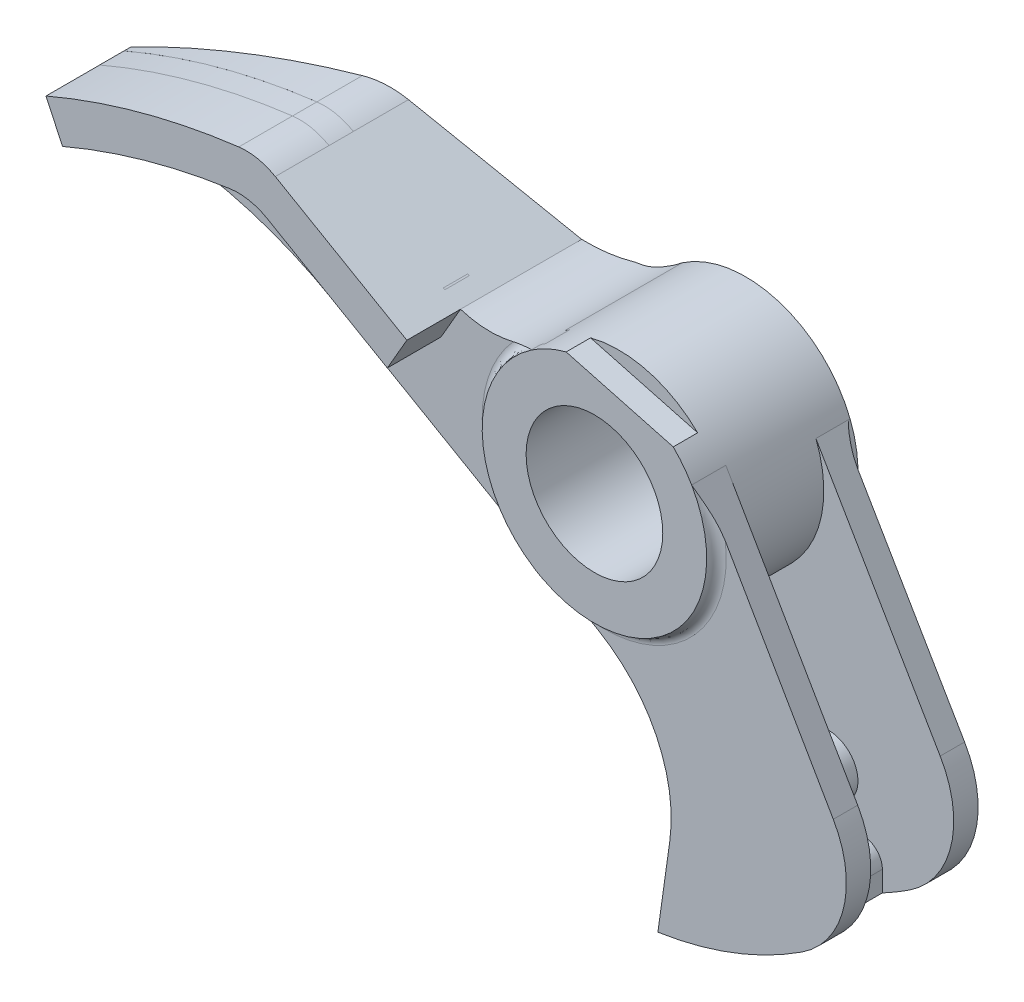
ISO-10303-21;
HEADER;
FILE_DESCRIPTION(('STEP AP214'),'2;1');
FILE_NAME('part.step','',(''),(''),'','','');
FILE_SCHEMA(('AUTOMOTIVE_DESIGN { 1 0 10303 214 1 1 1 1 }'));
ENDSEC;
DATA;
#1=APPLICATION_CONTEXT('core data for automotive mechanical design processes');
#2=APPLICATION_PROTOCOL_DEFINITION('international standard','automotive_design',2000,#1);
#3=PRODUCT_CONTEXT('',#1,'mechanical');
#4=PRODUCT('Part','Part','',(#3));
#5=PRODUCT_RELATED_PRODUCT_CATEGORY('part','',(#4));
#6=PRODUCT_DEFINITION_FORMATION('','',#4);
#7=PRODUCT_DEFINITION_CONTEXT('part definition',#1,'design');
#8=PRODUCT_DEFINITION('design','',#6,#7);
#9=PRODUCT_DEFINITION_SHAPE('','',#8);
#10=(LENGTH_UNIT() NAMED_UNIT(*) SI_UNIT(.MILLI.,.METRE.));
#11=(NAMED_UNIT(*) PLANE_ANGLE_UNIT() SI_UNIT($,.RADIAN.));
#12=(NAMED_UNIT(*) SI_UNIT($,.STERADIAN.) SOLID_ANGLE_UNIT());
#13=UNCERTAINTY_MEASURE_WITH_UNIT(LENGTH_MEASURE(1.E-05),#10,'distance_accuracy_value','');
#14=(GEOMETRIC_REPRESENTATION_CONTEXT(3) GLOBAL_UNCERTAINTY_ASSIGNED_CONTEXT((#13)) GLOBAL_UNIT_ASSIGNED_CONTEXT((#10,
#11,#12)) REPRESENTATION_CONTEXT('',''));
#15=CARTESIAN_POINT('',(0.,0.,0.));
#16=DIRECTION('',(0.,0.,1.));
#17=DIRECTION('',(1.,0.,0.));
#18=AXIS2_PLACEMENT_3D('',#15,#16,#17);
#19=CARTESIAN_POINT('',(12.,-24.,-4.25));
#20=DIRECTION('',(0.,0.,-1.));
#21=DIRECTION('',(-1.,0.,0.));
#22=AXIS2_PLACEMENT_3D('',#19,#20,#21);
#23=TOROIDAL_SURFACE('',#22,2.5,0.5);
#24=CARTESIAN_POINT('',(12.,-24.,-4.75));
#25=DIRECTION('',(0.,0.,-1.));
#26=DIRECTION('',(-1.,0.,0.));
#27=AXIS2_PLACEMENT_3D('',#24,#25,#26);
#28=CIRCLE('',#27,2.5);
#29=CARTESIAN_POINT('',(9.49999999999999,-24.,-4.75));
#30=VERTEX_POINT('',#29);
#31=EDGE_CURVE('E1009',#30,#30,#28,.T.);
#32=ORIENTED_EDGE('',*,*,#31,.F.);
#33=EDGE_LOOP('',(#32));
#34=FACE_BOUND('',#33,.T.);
#35=CARTESIAN_POINT('',(12.,-24.,-4.74909918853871));
#36=DIRECTION('',(0.,0.,-1.));
#37=DIRECTION('',(-1.,0.,0.));
#38=AXIS2_PLACEMENT_3D('',#35,#36,#37);
#39=CIRCLE('',#38,2.47);
#40=CARTESIAN_POINT('',(9.52999999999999,-24.,-4.74909918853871));
#41=VERTEX_POINT('',#40);
#42=EDGE_CURVE('E394',#41,#41,#39,.F.);
#43=ORIENTED_EDGE('',*,*,#42,.F.);
#44=EDGE_LOOP('',(#43));
#45=FACE_BOUND('',#44,.T.);
#46=ADVANCED_FACE('F36',(#34,#45),#23,.F.);
#47=CARTESIAN_POINT('',(12.,-24.,-4.25));
#48=DIRECTION('',(0.,0.,-1.));
#49=DIRECTION('',(-1.,0.,0.));
#50=AXIS2_PLACEMENT_3D('',#47,#48,#49);
#51=TOROIDAL_SURFACE('',#50,2.5,0.5);
#52=CARTESIAN_POINT('',(12.,-24.,-3.75));
#53=DIRECTION('',(0.,0.,-1.));
#54=DIRECTION('',(-1.,0.,0.));
#55=AXIS2_PLACEMENT_3D('',#52,#53,#54);
#56=CIRCLE('',#55,2.5);
#57=CARTESIAN_POINT('',(9.49999999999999,-24.,-3.75));
#58=VERTEX_POINT('',#57);
#59=EDGE_CURVE('E1006',#58,#58,#56,.F.);
#60=ORIENTED_EDGE('',*,*,#59,.F.);
#61=EDGE_LOOP('',(#60));
#62=FACE_BOUND('',#61,.T.);
#63=CARTESIAN_POINT('',(12.,-24.,-3.75090081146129));
#64=DIRECTION('',(0.,0.,1.));
#65=DIRECTION('',(1.,0.,0.));
#66=AXIS2_PLACEMENT_3D('',#63,#64,#65);
#67=CIRCLE('',#66,2.47);
#68=CARTESIAN_POINT('',(14.47,-24.,-3.75090081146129));
#69=VERTEX_POINT('',#68);
#70=EDGE_CURVE('E40',#69,#69,#67,.F.);
#71=ORIENTED_EDGE('',*,*,#70,.F.);
#72=EDGE_LOOP('',(#71));
#73=FACE_BOUND('',#72,.T.);
#74=ADVANCED_FACE('F791',(#62,#73),#51,.F.);
#75=CARTESIAN_POINT('',(0.,0.,2.5));
#76=DIRECTION('',(0.,0.,-1.));
#77=DIRECTION('',(-1.,0.,0.));
#78=AXIS2_PLACEMENT_3D('',#75,#76,#77);
#79=CYLINDRICAL_SURFACE('',#78,11.5);
#80=DIRECTION('',(0.,0.,1.));
#81=VECTOR('',#80,1.);
#82=CARTESIAN_POINT('',(-11.3358298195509,1.93622372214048,-11.));
#83=LINE('',#82,#81);
#84=CARTESIAN_POINT('',(-11.3358298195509,1.93622372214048,-12.));
#85=VERTEX_POINT('',#84);
#86=CARTESIAN_POINT('',(-11.3358298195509,1.93622372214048,0.));
#87=VERTEX_POINT('',#86);
#88=EDGE_CURVE('E1209',#85,#87,#83,.T.);
#89=ORIENTED_EDGE('',*,*,#88,.F.);
#90=CARTESIAN_POINT('',(0.,0.,-12.));
#91=DIRECTION('',(0.,0.,-1.));
#92=DIRECTION('',(-1.,0.,0.));
#93=AXIS2_PLACEMENT_3D('',#90,#91,#92);
#94=CIRCLE('',#93,11.5);
#95=CARTESIAN_POINT('',(-5.12349624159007,-10.2956197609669,-12.));
#96=VERTEX_POINT('',#95);
#97=EDGE_CURVE('E1184',#96,#85,#94,.T.);
#98=ORIENTED_EDGE('',*,*,#97,.F.);
#99=DIRECTION('',(0.,0.,1.));
#100=VECTOR('',#99,1.);
#101=CARTESIAN_POINT('',(-5.12349624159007,-10.2956197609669,-11.));
#102=LINE('',#101,#100);
#103=CARTESIAN_POINT('',(-5.12349624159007,-10.2956197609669,-8.5));
#104=VERTEX_POINT('',#103);
#105=EDGE_CURVE('E643',#96,#104,#102,.T.);
#106=ORIENTED_EDGE('',*,*,#105,.T.);
#107=CARTESIAN_POINT('',(0.,0.,-8.5));
#108=DIRECTION('',(0.,0.,1.));
#109=DIRECTION('',(-1.,0.,0.));
#110=AXIS2_PLACEMENT_3D('',#107,#108,#109);
#111=CIRCLE('',#110,11.5);
#112=CARTESIAN_POINT('',(10.6900296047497,4.23948900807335,-8.5));
#113=VERTEX_POINT('',#112);
#114=EDGE_CURVE('E1177',#104,#113,#111,.T.);
#115=ORIENTED_EDGE('',*,*,#114,.T.);
#116=DIRECTION('',(0.,0.,1.));
#117=VECTOR('',#116,1.);
#118=CARTESIAN_POINT('',(10.6900296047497,4.23948900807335,-11.));
#119=LINE('',#118,#117);
#120=CARTESIAN_POINT('',(10.6900296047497,4.23948900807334,-12.));
#121=VERTEX_POINT('',#120);
#122=EDGE_CURVE('E634',#121,#113,#119,.T.);
#123=ORIENTED_EDGE('',*,*,#122,.F.);
#124=CARTESIAN_POINT('',(-6.50363500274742,9.48434139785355,-12.));
#125=VERTEX_POINT('',#124);
#126=EDGE_CURVE('E1183',#125,#121,#94,.T.);
#127=ORIENTED_EDGE('',*,*,#126,.F.);
#128=DIRECTION('',(0.,0.,1.));
#129=VECTOR('',#128,1.);
#130=CARTESIAN_POINT('',(-6.50363500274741,9.48434139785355,-11.));
#131=LINE('',#130,#129);
#132=CARTESIAN_POINT('',(-6.50363500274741,9.48434139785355,0.));
#133=VERTEX_POINT('',#132);
#134=EDGE_CURVE('E1212',#125,#133,#131,.T.);
#135=ORIENTED_EDGE('',*,*,#134,.T.);
#136=CARTESIAN_POINT('',(0.,0.,0.));
#137=DIRECTION('',(0.,0.,-1.));
#138=DIRECTION('',(-1.,0.,0.));
#139=AXIS2_PLACEMENT_3D('',#136,#137,#138);
#140=CIRCLE('',#139,11.5);
#141=CARTESIAN_POINT('',(-5.99799627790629,9.81193358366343,0.));
#142=VERTEX_POINT('',#141);
#143=EDGE_CURVE('E417',#133,#142,#140,.T.);
#144=ORIENTED_EDGE('',*,*,#143,.T.);
#145=DIRECTION('',(0.,0.,-1.));
#146=VECTOR('',#145,1.);
#147=CARTESIAN_POINT('',(-5.99799627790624,9.81193358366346,2.5));
#148=LINE('',#147,#146);
#149=CARTESIAN_POINT('',(-5.99799627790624,9.81193358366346,2.5));
#150=VERTEX_POINT('',#149);
#151=EDGE_CURVE('E1013',#142,#150,#148,.F.);
#152=ORIENTED_EDGE('',*,*,#151,.T.);
#153=CARTESIAN_POINT('',(0.,0.,2.5));
#154=DIRECTION('',(0.,0.,1.));
#155=DIRECTION('',(1.,0.,0.));
#156=AXIS2_PLACEMENT_3D('',#153,#154,#155);
#157=CIRCLE('',#156,11.5);
#158=CARTESIAN_POINT('',(-6.50363500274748,9.48434139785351,2.5));
#159=VERTEX_POINT('',#158);
#160=EDGE_CURVE('E510',#150,#159,#157,.T.);
#161=ORIENTED_EDGE('',*,*,#160,.T.);
#162=DIRECTION('',(0.,0.,-1.));
#163=VECTOR('',#162,1.);
#164=CARTESIAN_POINT('',(-6.50363500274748,9.48434139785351,2.5));
#165=LINE('',#164,#163);
#166=CARTESIAN_POINT('',(-6.50363500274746,9.48434139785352,3.5));
#167=VERTEX_POINT('',#166);
#168=EDGE_CURVE('E1038',#159,#167,#165,.F.);
#169=ORIENTED_EDGE('',*,*,#168,.T.);
#170=CARTESIAN_POINT('',(0.,0.,3.5));
#171=DIRECTION('',(0.,0.,1.));
#172=DIRECTION('',(1.,0.,0.));
#173=AXIS2_PLACEMENT_3D('',#170,#171,#172);
#174=CIRCLE('',#173,11.5);
#175=CARTESIAN_POINT('',(-2.89721378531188,11.1290678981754,3.5));
#176=VERTEX_POINT('',#175);
#177=EDGE_CURVE('E511',#176,#167,#174,.T.);
#178=ORIENTED_EDGE('',*,*,#177,.F.);
#179=DIRECTION('',(0.,0.,1.));
#180=VECTOR('',#179,1.);
#181=CARTESIAN_POINT('',(-2.89721378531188,11.1290678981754,1.));
#182=LINE('',#181,#180);
#183=CARTESIAN_POINT('',(-2.89721378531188,11.1290678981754,1.));
#184=VERTEX_POINT('',#183);
#185=EDGE_CURVE('E502',#184,#176,#182,.T.);
#186=ORIENTED_EDGE('',*,*,#185,.F.);
#187=CARTESIAN_POINT('',(0.,0.,1.));
#188=DIRECTION('',(0.,0.,1.));
#189=DIRECTION('',(1.,0.,0.));
#190=AXIS2_PLACEMENT_3D('',#187,#188,#189);
#191=CIRCLE('',#190,11.5);
#192=CARTESIAN_POINT('',(8.07359468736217,8.18944862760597,1.));
#193=VERTEX_POINT('',#192);
#194=EDGE_CURVE('E497',#193,#184,#191,.T.);
#195=ORIENTED_EDGE('',*,*,#194,.F.);
#196=DIRECTION('',(0.,0.,1.));
#197=VECTOR('',#196,1.);
#198=CARTESIAN_POINT('',(8.07359468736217,8.18944862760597,1.));
#199=LINE('',#198,#197);
#200=CARTESIAN_POINT('',(8.07359468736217,8.18944862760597,3.5));
#201=VERTEX_POINT('',#200);
#202=EDGE_CURVE('E503',#193,#201,#199,.T.);
#203=ORIENTED_EDGE('',*,*,#202,.T.);
#204=CARTESIAN_POINT('',(9.95929214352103,5.75000000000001,3.5));
#205=VERTEX_POINT('',#204);
#206=EDGE_CURVE('E516',#205,#201,#174,.T.);
#207=ORIENTED_EDGE('',*,*,#206,.F.);
#208=DIRECTION('',(0.,0.,-1.));
#209=VECTOR('',#208,1.);
#210=CARTESIAN_POINT('',(9.95929214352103,5.75000000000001,2.5));
#211=LINE('',#210,#209);
#212=CARTESIAN_POINT('',(9.95929214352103,5.75000000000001,0.));
#213=VERTEX_POINT('',#212);
#214=EDGE_CURVE('E961',#205,#213,#211,.T.);
#215=ORIENTED_EDGE('',*,*,#214,.T.);
#216=CARTESIAN_POINT('',(-5.35371269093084,-10.1778072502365,0.));
#217=VERTEX_POINT('',#216);
#218=EDGE_CURVE('E1136',#213,#217,#140,.T.);
#219=ORIENTED_EDGE('',*,*,#218,.T.);
#220=CARTESIAN_POINT('',(-6.13738328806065,-9.72535482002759,0.));
#221=VERTEX_POINT('',#220);
#222=EDGE_CURVE('E1140',#217,#221,#140,.T.);
#223=ORIENTED_EDGE('',*,*,#222,.T.);
#224=EDGE_CURVE('E637',#221,#87,#140,.T.);
#225=ORIENTED_EDGE('',*,*,#224,.T.);
#226=EDGE_LOOP('',(#89,#98,#106,#115,#123,#127,#135,#144,#152,#161,#169,#178,#186,#195,#203,
#207,#215,#219,#223,#225));
#227=FACE_BOUND('',#226,.T.);
#228=ADVANCED_FACE('F797',(#227),#79,.T.);
#229=CARTESIAN_POINT('',(-6.13738328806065,-9.72535482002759,2.5));
#230=VERTEX_POINT('',#229);
#231=CARTESIAN_POINT('',(-5.35371269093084,-10.1778072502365,2.5));
#232=VERTEX_POINT('',#231);
#233=EDGE_CURVE('E506',#230,#232,#157,.T.);
#234=ORIENTED_EDGE('',*,*,#233,.T.);
#235=DIRECTION('',(0.,0.,-1.));
#236=VECTOR('',#235,1.);
#237=CARTESIAN_POINT('',(-5.35371269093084,-10.1778072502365,2.5));
#238=LINE('',#237,#236);
#239=CARTESIAN_POINT('',(-5.35371269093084,-10.1778072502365,3.5));
#240=VERTEX_POINT('',#239);
#241=EDGE_CURVE('E651',#232,#240,#238,.F.);
#242=ORIENTED_EDGE('',*,*,#241,.T.);
#243=CARTESIAN_POINT('',(-6.13738328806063,-9.7253548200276,3.5));
#244=VERTEX_POINT('',#243);
#245=EDGE_CURVE('E1045',#244,#240,#174,.T.);
#246=ORIENTED_EDGE('',*,*,#245,.F.);
#247=DIRECTION('',(0.,0.,-1.));
#248=VECTOR('',#247,1.);
#249=CARTESIAN_POINT('',(-6.13738328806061,-9.72535482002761,3.5));
#250=LINE('',#249,#248);
#251=EDGE_CURVE('E1040',#244,#230,#250,.T.);
#252=ORIENTED_EDGE('',*,*,#251,.T.);
#253=EDGE_LOOP('',(#234,#242,#246,#252));
#254=FACE_BOUND('',#253,.T.);
#255=ADVANCED_FACE('F883',(#254),#79,.T.);
#256=CARTESIAN_POINT('',(-11.4744399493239,18.1820578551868,0.));
#257=DIRECTION('',(0.,0.,-1.));
#258=DIRECTION('',(-1.,0.,0.));
#259=AXIS2_PLACEMENT_3D('',#256,#257,#258);
#260=PLANE('',#259);
#261=DIRECTION('',(-0.866025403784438,0.500000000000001,0.));
#262=VECTOR('',#261,1.);
#263=CARTESIAN_POINT('',(-13.2538782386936,3.04360949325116,0.));
#264=LINE('',#263,#262);
#265=CARTESIAN_POINT('',(-29.0154578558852,12.1435617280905,0.));
#266=VERTEX_POINT('',#265);
#267=EDGE_CURVE('E437',#87,#266,#264,.T.);
#268=ORIENTED_EDGE('',*,*,#267,.F.);
#269=ORIENTED_EDGE('',*,*,#224,.F.);
#270=DIRECTION('',(0.866025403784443,-0.499999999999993,0.));
#271=VECTOR('',#270,1.);
#272=CARTESIAN_POINT('',(-27.7670718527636,2.76255169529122,0.));
#273=LINE('',#272,#271);
#274=CARTESIAN_POINT('',(-27.7670718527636,2.76255169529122,0.));
#275=VERTEX_POINT('',#274);
#276=EDGE_CURVE('E595',#275,#221,#273,.T.);
#277=ORIENTED_EDGE('',*,*,#276,.F.);
#278=CARTESIAN_POINT('',(-47.7670718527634,-31.8784644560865,0.));
#279=DIRECTION('',(0.,0.,-1.));
#280=DIRECTION('',(-1.,0.,0.));
#281=AXIS2_PLACEMENT_3D('',#278,#279,#280);
#282=CIRCLE('',#281,40.);
#283=CARTESIAN_POINT('',(-50.0106949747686,8.05856291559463,0.));
#284=VERTEX_POINT('',#283);
#285=EDGE_CURVE('E592',#284,#275,#282,.T.);
#286=ORIENTED_EDGE('',*,*,#285,.F.);
#287=DIRECTION('',(0.422618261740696,-0.906307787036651,0.));
#288=VECTOR('',#287,1.);
#289=CARTESIAN_POINT('',(-50.0106949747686,8.05856291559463,0.));
#290=LINE('',#289,#288);
#291=CARTESIAN_POINT('',(-51.7011680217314,11.6837940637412,0.));
#292=VERTEX_POINT('',#291);
#293=EDGE_CURVE('E590',#292,#284,#290,.T.);
#294=ORIENTED_EDGE('',*,*,#293,.F.);
#295=CARTESIAN_POINT('',(-23.,-55.,0.));
#296=DIRECTION('',(0.,0.,1.));
#297=DIRECTION('',(1.,0.,0.));
#298=AXIS2_PLACEMENT_3D('',#295,#296,#297);
#299=CIRCLE('',#298,72.5981090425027);
#300=CARTESIAN_POINT('',(-51.6868773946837,11.689943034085,0.));
#301=VERTEX_POINT('',#300);
#302=EDGE_CURVE('E586',#301,#292,#299,.T.);
#303=ORIENTED_EDGE('',*,*,#302,.F.);
#304=DIRECTION('',(-0.422493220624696,0.906366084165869,0.));
#305=VECTOR('',#304,1.);
#306=CARTESIAN_POINT('',(-51.6876766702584,11.6916577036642,0.));
#307=LINE('',#306,#305);
#308=CARTESIAN_POINT('',(-49.9969004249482,8.06446992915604,0.));
#309=VERTEX_POINT('',#308);
#310=EDGE_CURVE('E447',#309,#301,#307,.T.);
#311=ORIENTED_EDGE('',*,*,#310,.F.);
#312=CARTESIAN_POINT('',(-23.,-55.,0.));
#313=DIRECTION('',(0.,0.,1.));
#314=DIRECTION('',(-1.,0.,0.));
#315=AXIS2_PLACEMENT_3D('',#312,#313,#314);
#316=CIRCLE('',#315,68.6);
#317=CARTESIAN_POINT('',(-32.8795592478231,12.8848606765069,0.));
#318=VERTEX_POINT('',#317);
#319=EDGE_CURVE('E443',#318,#309,#316,.T.);
#320=ORIENTED_EDGE('',*,*,#319,.F.);
#321=CARTESIAN_POINT('',(-32.0154578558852,6.94740930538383,0.));
#322=DIRECTION('',(0.,0.,1.));
#323=DIRECTION('',(-1.,0.,0.));
#324=AXIS2_PLACEMENT_3D('',#321,#322,#323);
#325=CIRCLE('',#324,6.00000000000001);
#326=EDGE_CURVE('E440',#266,#318,#325,.T.);
#327=ORIENTED_EDGE('',*,*,#326,.F.);
#328=EDGE_LOOP('',(#268,#269,#277,#286,#294,#303,#311,#320,#327));
#329=FACE_BOUND('',#328,.T.);
#330=ADVANCED_FACE('F878',(#329),#260,.T.);
#331=CARTESIAN_POINT('',(-16.4744399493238,9.52180381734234,2.5));
#332=DIRECTION('',(-0.499999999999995,-0.866025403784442,0.));
#333=DIRECTION('',(0.866025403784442,-0.499999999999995,0.));
#334=AXIS2_PLACEMENT_3D('',#331,#332,#333);
#335=PLANE('',#334);
#336=DIRECTION('',(0.,0.,-1.));
#337=VECTOR('',#336,1.);
#338=CARTESIAN_POINT('',(-16.4744399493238,9.52180381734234,2.5));
#339=LINE('',#338,#337);
#340=CARTESIAN_POINT('',(-16.4744399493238,9.52180381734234,2.5));
#341=VERTEX_POINT('',#340);
#342=CARTESIAN_POINT('',(-16.4744399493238,9.52180381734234,0.));
#343=VERTEX_POINT('',#342);
#344=EDGE_CURVE('E627',#341,#343,#339,.T.);
#345=ORIENTED_EDGE('',*,*,#344,.T.);
#346=DIRECTION('',(0.866025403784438,-0.500000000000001,0.));
#347=VECTOR('',#346,1.);
#348=CARTESIAN_POINT('',(-11.2538782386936,6.50771110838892,0.));
#349=LINE('',#348,#347);
#350=CARTESIAN_POINT('',(-16.3238227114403,9.4348449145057,0.));
#351=VERTEX_POINT('',#350);
#352=EDGE_CURVE('E435',#343,#351,#349,.T.);
#353=ORIENTED_EDGE('',*,*,#352,.T.);
#354=DIRECTION('',(0.,0.,1.));
#355=VECTOR('',#354,1.);
#356=CARTESIAN_POINT('',(-16.3238227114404,9.4348449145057,-8.5));
#357=LINE('',#356,#355);
#358=CARTESIAN_POINT('',(-16.3238227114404,9.4348449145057,2.5));
#359=VERTEX_POINT('',#358);
#360=EDGE_CURVE('E406',#351,#359,#357,.T.);
#361=ORIENTED_EDGE('',*,*,#360,.T.);
#362=DIRECTION('',(-0.866025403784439,0.5,0.));
#363=VECTOR('',#362,1.);
#364=CARTESIAN_POINT('',(-28.1969500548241,16.289798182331,2.5));
#365=LINE('',#364,#363);
#366=EDGE_CURVE('E528',#359,#341,#365,.T.);
#367=ORIENTED_EDGE('',*,*,#366,.T.);
#368=EDGE_LOOP('',(#345,#353,#361,#367));
#369=FACE_BOUND('',#368,.T.);
#370=DIRECTION('',(0.,0.,1.));
#371=VECTOR('',#370,1.);
#372=CARTESIAN_POINT('',(-14.7179798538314,8.50771110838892,-8.5));
#373=LINE('',#372,#371);
#374=CARTESIAN_POINT('',(-14.7179798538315,8.50771110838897,-9.90572382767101));
#375=VERTEX_POINT('',#374);
#376=CARTESIAN_POINT('',(-14.7179798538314,8.50771110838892,2.5));
#377=VERTEX_POINT('',#376);
#378=EDGE_CURVE('E386',#375,#377,#373,.T.);
#379=ORIENTED_EDGE('',*,*,#378,.F.);
#380=DIRECTION('',(0.835331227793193,-0.482278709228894,-0.263873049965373));
#381=VECTOR('',#380,1.);
#382=CARTESIAN_POINT('',(-11.2538782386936,6.50771110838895,-11.));
#383=LINE('',#382,#381);
#384=CARTESIAN_POINT('',(-28.1969500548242,16.289798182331,-5.64784759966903));
#385=VERTEX_POINT('',#384);
#386=EDGE_CURVE('E400',#385,#375,#383,.T.);
#387=ORIENTED_EDGE('',*,*,#386,.F.);
#388=DIRECTION('',(0.,0.,1.));
#389=VECTOR('',#388,1.);
#390=CARTESIAN_POINT('',(-28.1969500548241,16.2897981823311,-11.));
#391=LINE('',#390,#389);
#392=CARTESIAN_POINT('',(-28.1969500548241,16.2897981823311,0.));
#393=VERTEX_POINT('',#392);
#394=EDGE_CURVE('E462',#385,#393,#391,.T.);
#395=ORIENTED_EDGE('',*,*,#394,.T.);
#396=CARTESIAN_POINT('',(-31.1942332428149,11.0920772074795,0.));
#397=DIRECTION('',(0.,0.,1.));
#398=DIRECTION('',(1.,0.,0.));
#399=AXIS2_PLACEMENT_3D('',#396,#397,#398);
#400=CIRCLE('',#399,5.99999999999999);
#401=CARTESIAN_POINT('',(-28.1942332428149,16.2882296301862,0.));
#402=VERTEX_POINT('',#401);
#403=EDGE_CURVE('E583',#402,#393,#400,.T.);
#404=ORIENTED_EDGE('',*,*,#403,.F.);
#405=DIRECTION('',(0.,0.,-1.));
#406=VECTOR('',#405,1.);
#407=CARTESIAN_POINT('',(-28.194233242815,16.2882296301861,2.5));
#408=LINE('',#407,#406);
#409=CARTESIAN_POINT('',(-28.194233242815,16.2882296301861,2.5));
#410=VERTEX_POINT('',#409);
#411=EDGE_CURVE('E996',#410,#402,#408,.T.);
#412=ORIENTED_EDGE('',*,*,#411,.F.);
#413=CARTESIAN_POINT('',(-31.1942332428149,11.0920772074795,2.5));
#414=DIRECTION('',(0.,0.,1.));
#415=DIRECTION('',(1.,0.,0.));
#416=AXIS2_PLACEMENT_3D('',#413,#414,#415);
#417=CIRCLE('',#416,5.99999999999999);
#418=CARTESIAN_POINT('',(-28.196950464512,16.2897974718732,2.5));
#419=VERTEX_POINT('',#418);
#420=EDGE_CURVE('E615',#410,#419,#417,.T.);
#421=ORIENTED_EDGE('',*,*,#420,.T.);
#422=DIRECTION('',(0.,0.,-1.));
#423=VECTOR('',#422,1.);
#424=CARTESIAN_POINT('',(-28.1969500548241,16.289798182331,8.));
#425=LINE('',#424,#423);
#426=CARTESIAN_POINT('',(-28.1969500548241,16.289798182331,8.));
#427=VERTEX_POINT('',#426);
#428=EDGE_CURVE('E570',#427,#419,#425,.T.);
#429=ORIENTED_EDGE('',*,*,#428,.F.);
#430=DIRECTION('',(-0.866025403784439,0.5,0.));
#431=VECTOR('',#430,1.);
#432=CARTESIAN_POINT('',(-28.1969500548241,16.289798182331,8.));
#433=LINE('',#432,#431);
#434=CARTESIAN_POINT('',(-14.7179798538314,8.50771110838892,8.));
#435=VERTEX_POINT('',#434);
#436=EDGE_CURVE('E547',#435,#427,#433,.T.);
#437=ORIENTED_EDGE('',*,*,#436,.F.);
#438=DIRECTION('',(0.,0.,-1.));
#439=VECTOR('',#438,1.);
#440=CARTESIAN_POINT('',(-14.7179798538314,8.50771110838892,8.));
#441=LINE('',#440,#439);
#442=EDGE_CURVE('E404',#435,#377,#441,.T.);
#443=ORIENTED_EDGE('',*,*,#442,.T.);
#444=EDGE_LOOP('',(#379,#387,#395,#404,#412,#421,#429,#437,#443));
#445=FACE_BOUND('',#444,.T.);
#446=ADVANCED_FACE('F399',(#369,#445),#335,.F.);
#447=CARTESIAN_POINT('',(12.,-24.,0.));
#448=DIRECTION('',(0.,0.,-1.));
#449=DIRECTION('',(-1.,0.,0.));
#450=AXIS2_PLACEMENT_3D('',#447,#448,#449);
#451=CIRCLE('',#450,3.);
#452=CARTESIAN_POINT('',(8.99999999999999,-24.,0.));
#453=VERTEX_POINT('',#452);
#454=EDGE_CURVE('E488',#453,#453,#451,.T.);
#455=ORIENTED_EDGE('',*,*,#454,.F.);
#456=EDGE_LOOP('',(#455));
#457=FACE_BOUND('',#456,.T.);
#458=CARTESIAN_POINT('',(0.,0.,0.));
#459=DIRECTION('',(0.,0.,1.));
#460=DIRECTION('',(1.,0.,0.));
#461=AXIS2_PLACEMENT_3D('',#458,#459,#460);
#462=CIRCLE('',#461,37.0657906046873);
#463=CARTESIAN_POINT('',(17.5,-32.6744982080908,0.));
#464=VERTEX_POINT('',#463);
#465=CARTESIAN_POINT('',(20.2875892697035,-31.0207439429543,0.));
#466=VERTEX_POINT('',#465);
#467=EDGE_CURVE('E603',#464,#466,#462,.T.);
#468=ORIENTED_EDGE('',*,*,#467,.F.);
#469=DIRECTION('',(0.,1.,0.));
#470=VECTOR('',#469,1.);
#471=CARTESIAN_POINT('',(17.5,-32.6744982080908,0.));
#472=LINE('',#471,#470);
#473=CARTESIAN_POINT('',(17.5,-30.5746035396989,0.));
#474=VERTEX_POINT('',#473);
#475=EDGE_CURVE('E1198',#464,#474,#472,.T.);
#476=ORIENTED_EDGE('',*,*,#475,.T.);
#477=CARTESIAN_POINT('',(15.5,-30.5746035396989,0.));
#478=DIRECTION('',(0.,0.,-1.));
#479=DIRECTION('',(-1.,0.,0.));
#480=AXIS2_PLACEMENT_3D('',#477,#478,#479);
#481=CIRCLE('',#480,2.);
#482=CARTESIAN_POINT('',(14.5956587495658,-28.7907406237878,0.));
#483=VERTEX_POINT('',#482);
#484=EDGE_CURVE('E1033',#474,#483,#481,.F.);
#485=ORIENTED_EDGE('',*,*,#484,.T.);
#486=CARTESIAN_POINT('',(0.,0.,0.));
#487=DIRECTION('',(0.,0.,-1.));
#488=DIRECTION('',(1.,0.,0.));
#489=AXIS2_PLACEMENT_3D('',#486,#487,#488);
#490=CIRCLE('',#489,32.2790954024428);
#491=CARTESIAN_POINT('',(6.19951359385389,-31.6781633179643,0.));
#492=VERTEX_POINT('',#491);
#493=EDGE_CURVE('E1196',#483,#492,#490,.T.);
#494=ORIENTED_EDGE('',*,*,#493,.T.);
#495=DIRECTION('',(-0.139173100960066,-0.99026806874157,0.));
#496=VECTOR('',#495,1.);
#497=CARTESIAN_POINT('',(6.71922134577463,-27.9802505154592,0.));
#498=LINE('',#497,#496);
#499=CARTESIAN_POINT('',(6.71922134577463,-27.9802505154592,0.));
#500=VERTEX_POINT('',#499);
#501=EDGE_CURVE('E600',#500,#492,#498,.T.);
#502=ORIENTED_EDGE('',*,*,#501,.F.);
#503=CARTESIAN_POINT('',(-8.13479968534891,-25.8926540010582,0.));
#504=DIRECTION('',(0.,0.,-1.));
#505=DIRECTION('',(1.,0.,0.));
#506=AXIS2_PLACEMENT_3D('',#503,#504,#505);
#507=CIRCLE('',#506,15.);
#508=CARTESIAN_POINT('',(-0.63479968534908,-12.9022729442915,0.));
#509=VERTEX_POINT('',#508);
#510=EDGE_CURVE('E598',#509,#500,#507,.T.);
#511=ORIENTED_EDGE('',*,*,#510,.F.);
#512=EDGE_CURVE('E594',#217,#509,#273,.T.);
#513=ORIENTED_EDGE('',*,*,#512,.F.);
#514=ORIENTED_EDGE('',*,*,#218,.F.);
#515=DIRECTION('',(-0.500000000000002,0.866025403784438,0.));
#516=VECTOR('',#515,1.);
#517=CARTESIAN_POINT('',(9.95929214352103,5.75000000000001,0.));
#518=LINE('',#517,#516);
#519=CARTESIAN_POINT('',(23.4713892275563,-17.6536386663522,0.));
#520=VERTEX_POINT('',#519);
#521=EDGE_CURVE('E607',#520,#213,#518,.T.);
#522=ORIENTED_EDGE('',*,*,#521,.F.);
#523=CARTESIAN_POINT('',(14.8111351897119,-22.6536386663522,0.));
#524=DIRECTION('',(0.,0.,1.));
#525=DIRECTION('',(-1.,0.,0.));
#526=AXIS2_PLACEMENT_3D('',#523,#524,#525);
#527=CIRCLE('',#526,10.);
#528=EDGE_CURVE('E605',#466,#520,#527,.T.);
#529=ORIENTED_EDGE('',*,*,#528,.F.);
#530=EDGE_LOOP('',(#468,#476,#485,#494,#502,#511,#513,#514,#522,#529));
#531=FACE_BOUND('',#530,.T.);
#532=ADVANCED_FACE('F715',(#457,#531),#260,.T.);
#533=CARTESIAN_POINT('',(0.,0.,-8.5));
#534=DIRECTION('',(0.,0.,-1.));
#535=DIRECTION('',(-1.,0.,0.));
#536=AXIS2_PLACEMENT_3D('',#533,#534,#535);
#537=PLANE('',#536);
#538=CARTESIAN_POINT('',(12.,-24.,-8.5));
#539=DIRECTION('',(0.,0.,-1.));
#540=DIRECTION('',(-1.,0.,0.));
#541=AXIS2_PLACEMENT_3D('',#538,#539,#540);
#542=CIRCLE('',#541,3.);
#543=CARTESIAN_POINT('',(8.99999999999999,-24.,-8.5));
#544=VERTEX_POINT('',#543);
#545=EDGE_CURVE('E485',#544,#544,#542,.T.);
#546=ORIENTED_EDGE('',*,*,#545,.T.);
#547=EDGE_LOOP('',(#546));
#548=FACE_BOUND('',#547,.T.);
#549=DIRECTION('',(0.,1.,0.));
#550=VECTOR('',#549,1.);
#551=CARTESIAN_POINT('',(17.5,-32.6744982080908,-8.5));
#552=LINE('',#551,#550);
#553=CARTESIAN_POINT('',(17.5,-32.6744982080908,-8.5));
#554=VERTEX_POINT('',#553);
#555=CARTESIAN_POINT('',(17.5,-30.5746035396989,-8.5));
#556=VERTEX_POINT('',#555);
#557=EDGE_CURVE('E1206',#554,#556,#552,.T.);
#558=ORIENTED_EDGE('',*,*,#557,.F.);
#559=CARTESIAN_POINT('',(0.,0.,-8.5));
#560=DIRECTION('',(0.,0.,-1.));
#561=DIRECTION('',(1.,0.,0.));
#562=AXIS2_PLACEMENT_3D('',#559,#560,#561);
#563=CIRCLE('',#562,37.0657910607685);
#564=CARTESIAN_POINT('',(20.2834064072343,-31.0234802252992,-8.5));
#565=VERTEX_POINT('',#564);
#566=EDGE_CURVE('E1170',#565,#554,#563,.T.);
#567=ORIENTED_EDGE('',*,*,#566,.F.);
#568=CARTESIAN_POINT('',(14.8111351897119,-22.6536386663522,-8.5));
#569=DIRECTION('',(0.,0.,-1.));
#570=DIRECTION('',(-1.,0.,0.));
#571=AXIS2_PLACEMENT_3D('',#568,#569,#570);
#572=CIRCLE('',#571,10.);
#573=CARTESIAN_POINT('',(23.4226965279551,-17.5702331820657,-8.5));
#574=VERTEX_POINT('',#573);
#575=EDGE_CURVE('E1173',#574,#565,#572,.T.);
#576=ORIENTED_EDGE('',*,*,#575,.F.);
#577=DIRECTION('',(0.504176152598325,-0.863600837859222,0.));
#578=VECTOR('',#577,1.);
#579=CARTESIAN_POINT('',(10.6900296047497,4.23948900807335,-8.5));
#580=LINE('',#579,#578);
#581=EDGE_CURVE('E1175',#113,#574,#580,.T.);
#582=ORIENTED_EDGE('',*,*,#581,.F.);
#583=ORIENTED_EDGE('',*,*,#114,.F.);
#584=DIRECTION('',(-0.851501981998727,0.524351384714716,0.));
#585=VECTOR('',#584,1.);
#586=CARTESIAN_POINT('',(-2.08468176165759,-12.166909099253,-8.5));
#587=LINE('',#586,#585);
#588=CARTESIAN_POINT('',(-2.08468176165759,-12.166909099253,-8.5));
#589=VERTEX_POINT('',#588);
#590=EDGE_CURVE('E650',#589,#104,#587,.T.);
#591=ORIENTED_EDGE('',*,*,#590,.F.);
#592=CARTESIAN_POINT('',(-8.13479968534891,-25.8926540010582,-8.5));
#593=DIRECTION('',(0.,0.,1.));
#594=DIRECTION('',(-1.,0.,0.));
#595=AXIS2_PLACEMENT_3D('',#592,#593,#594);
#596=CIRCLE('',#595,15.);
#597=CARTESIAN_POINT('',(6.82181348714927,-27.0327076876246,-8.5));
#598=VERTEX_POINT('',#597);
#599=EDGE_CURVE('E1166',#598,#589,#596,.T.);
#600=ORIENTED_EDGE('',*,*,#599,.F.);
#601=DIRECTION('',(0.13608545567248,0.990697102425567,0.));
#602=VECTOR('',#601,1.);
#603=CARTESIAN_POINT('',(6.82181348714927,-27.0327076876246,-8.5));
#604=LINE('',#603,#602);
#605=CARTESIAN_POINT('',(5.50000006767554,-36.6554616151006,-8.5));
#606=VERTEX_POINT('',#605);
#607=EDGE_CURVE('E1168',#606,#598,#604,.T.);
#608=ORIENTED_EDGE('',*,*,#607,.F.);
#609=DIRECTION('',(-0.139173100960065,-0.99026806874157,0.));
#610=VECTOR('',#609,1.);
#611=CARTESIAN_POINT('',(5.50000000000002,-36.6554611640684,-8.5));
#612=LINE('',#611,#610);
#613=CARTESIAN_POINT('',(6.19951359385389,-31.6781633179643,-8.5));
#614=VERTEX_POINT('',#613);
#615=EDGE_CURVE('E1201',#614,#606,#612,.T.);
#616=ORIENTED_EDGE('',*,*,#615,.F.);
#617=CARTESIAN_POINT('',(0.,0.,-8.5));
#618=DIRECTION('',(0.,0.,-1.));
#619=DIRECTION('',(1.,0.,0.));
#620=AXIS2_PLACEMENT_3D('',#617,#618,#619);
#621=CIRCLE('',#620,32.2790954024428);
#622=CARTESIAN_POINT('',(14.5956587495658,-28.7907406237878,-8.5));
#623=VERTEX_POINT('',#622);
#624=EDGE_CURVE('E1204',#623,#614,#621,.T.);
#625=ORIENTED_EDGE('',*,*,#624,.F.);
#626=CARTESIAN_POINT('',(15.5,-30.5746035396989,-8.5));
#627=DIRECTION('',(0.,0.,-1.));
#628=DIRECTION('',(-1.,0.,0.));
#629=AXIS2_PLACEMENT_3D('',#626,#627,#628);
#630=CIRCLE('',#629,2.);
#631=EDGE_CURVE('E1028',#623,#556,#630,.T.);
#632=ORIENTED_EDGE('',*,*,#631,.T.);
#633=EDGE_LOOP('',(#558,#567,#576,#582,#583,#591,#600,#608,#616,#625,#632));
#634=FACE_BOUND('',#633,.T.);
#635=ADVANCED_FACE('F711',(#548,#634),#537,.F.);
#636=DIRECTION('',(0.999333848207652,0.0364946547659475,0.));
#637=VECTOR('',#636,1.);
#638=CARTESIAN_POINT('',(-11.1618847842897,9.62335363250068,0.));
#639=LINE('',#638,#637);
#640=CARTESIAN_POINT('',(-16.3208959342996,9.43495179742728,0.));
#641=VERTEX_POINT('',#640);
#642=EDGE_CURVE('E476',#351,#641,#639,.T.);
#643=ORIENTED_EDGE('',*,*,#642,.F.);
#644=ORIENTED_EDGE('',*,*,#352,.F.);
#645=CARTESIAN_POINT('',(-11.4744399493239,18.1820578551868,0.));
#646=DIRECTION('',(0.,0.,-1.));
#647=DIRECTION('',(-1.,0.,0.));
#648=AXIS2_PLACEMENT_3D('',#645,#646,#647);
#649=CIRCLE('',#648,10.);
#650=EDGE_CURVE('E580',#641,#343,#649,.T.);
#651=ORIENTED_EDGE('',*,*,#650,.F.);
#652=EDGE_LOOP('',(#643,#644,#651));
#653=FACE_BOUND('',#652,.T.);
#654=ADVANCED_FACE('F714',(#653),#260,.T.);
#655=CARTESIAN_POINT('',(-11.4744399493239,18.1820578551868,2.5));
#656=DIRECTION('',(0.,0.,-1.));
#657=DIRECTION('',(-1.,0.,0.));
#658=AXIS2_PLACEMENT_3D('',#655,#656,#657);
#659=PLANE('',#658);
#660=DIRECTION('',(0.866025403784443,-0.499999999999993,0.));
#661=VECTOR('',#660,1.);
#662=CARTESIAN_POINT('',(-27.7670718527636,2.76255169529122,2.5));
#663=LINE('',#662,#661);
#664=CARTESIAN_POINT('',(-27.7670718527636,2.76255169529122,2.5));
#665=VERTEX_POINT('',#664);
#666=CARTESIAN_POINT('',(-10.0062445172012,-7.491666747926,2.5));
#667=VERTEX_POINT('',#666);
#668=EDGE_CURVE('E1121',#665,#667,#663,.T.);
#669=ORIENTED_EDGE('',*,*,#668,.T.);
#670=CARTESIAN_POINT('',(0.,0.,2.5));
#671=DIRECTION('',(0.,0.,-1.));
#672=DIRECTION('',(-1.,0.,0.));
#673=AXIS2_PLACEMENT_3D('',#670,#671,#672);
#674=CIRCLE('',#673,12.5);
#675=CARTESIAN_POINT('',(-9.33045383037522,8.31821082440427,2.5));
#676=VERTEX_POINT('',#675);
#677=EDGE_CURVE('E657',#667,#676,#674,.T.);
#678=ORIENTED_EDGE('',*,*,#677,.T.);
#679=CARTESIAN_POINT('',(-11.6857056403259,18.0368932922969,2.5));
#680=DIRECTION('',(0.,0.,1.));
#681=DIRECTION('',(-1.,0.,0.));
#682=AXIS2_PLACEMENT_3D('',#679,#680,#681);
#683=CIRCLE('',#682,10.);
#684=EDGE_CURVE('E468',#377,#676,#683,.T.);
#685=ORIENTED_EDGE('',*,*,#684,.F.);
#686=DIRECTION('',(0.5,0.866025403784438,0.));
#687=VECTOR('',#686,1.);
#688=CARTESIAN_POINT('',(-14.7179798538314,8.50771110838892,2.5));
#689=LINE('',#688,#687);
#690=CARTESIAN_POINT('',(-16.7179798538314,5.04360949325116,2.5));
#691=VERTEX_POINT('',#690);
#692=EDGE_CURVE('E525',#691,#377,#689,.T.);
#693=ORIENTED_EDGE('',*,*,#692,.F.);
#694=DIRECTION('',(0.866025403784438,-0.5,0.));
#695=VECTOR('',#694,1.);
#696=CARTESIAN_POINT('',(-29.0154578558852,12.1435617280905,2.5));
#697=LINE('',#696,#695);
#698=CARTESIAN_POINT('',(-29.0154578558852,12.1435617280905,2.5));
#699=VERTEX_POINT('',#698);
#700=EDGE_CURVE('E522',#699,#691,#697,.T.);
#701=ORIENTED_EDGE('',*,*,#700,.F.);
#702=CARTESIAN_POINT('',(-32.0154578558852,6.94740930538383,2.5));
#703=DIRECTION('',(0.,0.,-1.));
#704=DIRECTION('',(1.,0.,0.));
#705=AXIS2_PLACEMENT_3D('',#702,#703,#704);
#706=CIRCLE('',#705,6.);
#707=CARTESIAN_POINT('',(-32.8795592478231,12.8848606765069,2.5));
#708=VERTEX_POINT('',#707);
#709=EDGE_CURVE('E519',#708,#699,#706,.T.);
#710=ORIENTED_EDGE('',*,*,#709,.F.);
#711=CARTESIAN_POINT('',(-23.,-55.,2.5));
#712=DIRECTION('',(0.,0.,-1.));
#713=DIRECTION('',(1.,0.,0.));
#714=AXIS2_PLACEMENT_3D('',#711,#712,#713);
#715=CIRCLE('',#714,68.6);
#716=CARTESIAN_POINT('',(-49.9969004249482,8.06446992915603,2.5));
#717=VERTEX_POINT('',#716);
#718=EDGE_CURVE('E536',#717,#708,#715,.T.);
#719=ORIENTED_EDGE('',*,*,#718,.F.);
#720=DIRECTION('',(0.422493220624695,-0.90636608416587,0.));
#721=VECTOR('',#720,1.);
#722=CARTESIAN_POINT('',(-51.6876766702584,11.6916577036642,2.5));
#723=LINE('',#722,#721);
#724=CARTESIAN_POINT('',(-51.6868773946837,11.689943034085,2.5));
#725=VERTEX_POINT('',#724);
#726=EDGE_CURVE('E537',#725,#717,#723,.T.);
#727=ORIENTED_EDGE('',*,*,#726,.F.);
#728=CARTESIAN_POINT('',(-23.,-55.,2.5));
#729=DIRECTION('',(0.,0.,1.));
#730=DIRECTION('',(1.,0.,0.));
#731=AXIS2_PLACEMENT_3D('',#728,#729,#730);
#732=CIRCLE('',#731,72.5981090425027);
#733=CARTESIAN_POINT('',(-51.7011680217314,11.6837940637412,2.5));
#734=VERTEX_POINT('',#733);
#735=EDGE_CURVE('E622',#725,#734,#732,.T.);
#736=ORIENTED_EDGE('',*,*,#735,.T.);
#737=DIRECTION('',(0.422618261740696,-0.906307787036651,0.));
#738=VECTOR('',#737,1.);
#739=CARTESIAN_POINT('',(-50.0106949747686,8.05856291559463,2.5));
#740=LINE('',#739,#738);
#741=CARTESIAN_POINT('',(-50.0106949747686,8.05856291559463,2.5));
#742=VERTEX_POINT('',#741);
#743=EDGE_CURVE('E1093',#734,#742,#740,.T.);
#744=ORIENTED_EDGE('',*,*,#743,.T.);
#745=CARTESIAN_POINT('',(-47.7670718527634,-31.8784644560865,2.5));
#746=DIRECTION('',(0.,0.,-1.));
#747=DIRECTION('',(-1.,0.,0.));
#748=AXIS2_PLACEMENT_3D('',#745,#746,#747);
#749=CIRCLE('',#748,40.);
#750=EDGE_CURVE('E1117',#742,#665,#749,.T.);
#751=ORIENTED_EDGE('',*,*,#750,.T.);
#752=EDGE_LOOP('',(#669,#678,#685,#693,#701,#710,#719,#727,#736,#744,#751));
#753=FACE_BOUND('',#752,.T.);
#754=ADVANCED_FACE('F817',(#753),#659,.F.);
#755=CARTESIAN_POINT('',(12.,-24.,-3.75));
#756=DIRECTION('',(0.,0.,-1.));
#757=DIRECTION('',(-1.,0.,0.));
#758=AXIS2_PLACEMENT_3D('',#755,#756,#757);
#759=PLANE('',#758);
#760=ORIENTED_EDGE('',*,*,#59,.T.);
#761=EDGE_LOOP('',(#760));
#762=FACE_BOUND('',#761,.T.);
#763=CARTESIAN_POINT('',(12.,-24.,-3.75));
#764=DIRECTION('',(0.,0.,-1.));
#765=DIRECTION('',(-1.,0.,0.));
#766=AXIS2_PLACEMENT_3D('',#763,#764,#765);
#767=CIRCLE('',#766,3.);
#768=CARTESIAN_POINT('',(8.99999999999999,-24.,-3.75));
#769=VERTEX_POINT('',#768);
#770=EDGE_CURVE('E491',#769,#769,#767,.T.);
#771=ORIENTED_EDGE('',*,*,#770,.T.);
#772=EDGE_LOOP('',(#771));
#773=FACE_BOUND('',#772,.T.);
#774=ADVANCED_FACE('F813',(#762,#773),#759,.T.);
#775=DIRECTION('',(-0.500000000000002,0.866025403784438,0.));
#776=VECTOR('',#775,1.);
#777=CARTESIAN_POINT('',(9.95929214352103,5.75000000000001,2.5));
#778=LINE('',#777,#776);
#779=CARTESIAN_POINT('',(23.4713892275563,-17.6536386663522,2.5));
#780=VERTEX_POINT('',#779);
#781=CARTESIAN_POINT('',(12.4087818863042,1.50735931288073,2.5));
#782=VERTEX_POINT('',#781);
#783=EDGE_CURVE('E959',#780,#782,#778,.T.);
#784=ORIENTED_EDGE('',*,*,#783,.T.);
#785=CARTESIAN_POINT('',(0.,0.,2.5));
#786=DIRECTION('',(0.,0.,-1.));
#787=DIRECTION('',(-1.,0.,0.));
#788=AXIS2_PLACEMENT_3D('',#785,#786,#787);
#789=CIRCLE('',#788,12.5);
#790=CARTESIAN_POINT('',(-1.48485146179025,-12.4114953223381,2.5));
#791=VERTEX_POINT('',#790);
#792=EDGE_CURVE('E655',#782,#791,#789,.T.);
#793=ORIENTED_EDGE('',*,*,#792,.T.);
#794=CARTESIAN_POINT('',(-0.63479968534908,-12.9022729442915,2.5));
#795=VERTEX_POINT('',#794);
#796=EDGE_CURVE('E1118',#791,#795,#663,.T.);
#797=ORIENTED_EDGE('',*,*,#796,.T.);
#798=CARTESIAN_POINT('',(-8.13479968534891,-25.8926540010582,2.5));
#799=DIRECTION('',(0.,0.,-1.));
#800=DIRECTION('',(1.,0.,0.));
#801=AXIS2_PLACEMENT_3D('',#798,#799,#800);
#802=CIRCLE('',#801,15.);
#803=CARTESIAN_POINT('',(6.71922134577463,-27.9802505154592,2.5));
#804=VERTEX_POINT('',#803);
#805=EDGE_CURVE('E1123',#795,#804,#802,.T.);
#806=ORIENTED_EDGE('',*,*,#805,.T.);
#807=DIRECTION('',(-0.139173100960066,-0.99026806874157,0.));
#808=VECTOR('',#807,1.);
#809=CARTESIAN_POINT('',(6.71922134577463,-27.9802505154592,2.5));
#810=LINE('',#809,#808);
#811=CARTESIAN_POINT('',(5.50000000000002,-36.6554611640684,2.5));
#812=VERTEX_POINT('',#811);
#813=EDGE_CURVE('E1125',#804,#812,#810,.T.);
#814=ORIENTED_EDGE('',*,*,#813,.T.);
#815=CARTESIAN_POINT('',(0.,0.,2.5));
#816=DIRECTION('',(0.,0.,1.));
#817=DIRECTION('',(1.,0.,0.));
#818=AXIS2_PLACEMENT_3D('',#815,#816,#817);
#819=CIRCLE('',#818,37.0657906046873);
#820=CARTESIAN_POINT('',(20.2875892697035,-31.0207439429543,2.5));
#821=VERTEX_POINT('',#820);
#822=EDGE_CURVE('E969',#812,#821,#819,.T.);
#823=ORIENTED_EDGE('',*,*,#822,.T.);
#824=CARTESIAN_POINT('',(14.8111351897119,-22.6536386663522,2.5));
#825=DIRECTION('',(0.,0.,1.));
#826=DIRECTION('',(-1.,0.,0.));
#827=AXIS2_PLACEMENT_3D('',#824,#825,#826);
#828=CIRCLE('',#827,10.);
#829=EDGE_CURVE('E964',#821,#780,#828,.T.);
#830=ORIENTED_EDGE('',*,*,#829,.T.);
#831=EDGE_LOOP('',(#784,#793,#797,#806,#814,#823,#830));
#832=FACE_BOUND('',#831,.T.);
#833=ADVANCED_FACE('F816',(#832),#659,.F.);
#834=ORIENTED_EDGE('',*,*,#366,.F.);
#835=DIRECTION('',(-0.999333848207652,-0.0364946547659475,0.));
#836=VECTOR('',#835,1.);
#837=CARTESIAN_POINT('',(-16.3238227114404,9.4348449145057,2.5));
#838=LINE('',#837,#836);
#839=CARTESIAN_POINT('',(-16.3208959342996,9.43495179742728,2.5));
#840=VERTEX_POINT('',#839);
#841=EDGE_CURVE('E470',#840,#359,#838,.T.);
#842=ORIENTED_EDGE('',*,*,#841,.F.);
#843=CARTESIAN_POINT('',(-11.4744399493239,18.1820578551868,2.5));
#844=DIRECTION('',(0.,0.,-1.));
#845=DIRECTION('',(-1.,0.,0.));
#846=AXIS2_PLACEMENT_3D('',#843,#844,#845);
#847=CIRCLE('',#846,10.);
#848=EDGE_CURVE('E610',#840,#341,#847,.T.);
#849=ORIENTED_EDGE('',*,*,#848,.T.);
#850=EDGE_LOOP('',(#834,#842,#849));
#851=FACE_BOUND('',#850,.T.);
#852=ADVANCED_FACE('F881',(#851),#659,.F.);
#853=CARTESIAN_POINT('',(-11.4744399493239,18.1820578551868,2.5));
#854=DIRECTION('',(0.,0.,-1.));
#855=DIRECTION('',(-1.,0.,0.));
#856=AXIS2_PLACEMENT_3D('',#853,#854,#855);
#857=CYLINDRICAL_SURFACE('',#856,10.);
#858=ORIENTED_EDGE('',*,*,#848,.F.);
#859=DIRECTION('',(0.,0.,-1.));
#860=VECTOR('',#859,1.);
#861=CARTESIAN_POINT('',(-16.3208959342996,9.43495179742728,2.5));
#862=LINE('',#861,#860);
#863=EDGE_CURVE('E405',#840,#641,#862,.T.);
#864=ORIENTED_EDGE('',*,*,#863,.T.);
#865=ORIENTED_EDGE('',*,*,#650,.T.);
#866=ORIENTED_EDGE('',*,*,#344,.F.);
#867=EDGE_LOOP('',(#858,#864,#865,#866));
#868=FACE_BOUND('',#867,.T.);
#869=ADVANCED_FACE('F38',(#868),#857,.F.);
#870=CARTESIAN_POINT('',(-31.1942332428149,11.0920772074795,2.5));
#871=DIRECTION('',(0.,0.,-1.));
#872=DIRECTION('',(-1.,0.,0.));
#873=AXIS2_PLACEMENT_3D('',#870,#871,#872);
#874=CYLINDRICAL_SURFACE('',#873,5.99999999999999);
#875=ORIENTED_EDGE('',*,*,#403,.T.);
#876=CARTESIAN_POINT('',(-31.1942332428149,11.0920772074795,0.));
#877=DIRECTION('',(0.,0.,-1.));
#878=DIRECTION('',(-1.,0.,0.));
#879=AXIS2_PLACEMENT_3D('',#876,#877,#878);
#880=CIRCLE('',#879,5.99999999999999);
#881=CARTESIAN_POINT('',(-31.9324734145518,17.0464874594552,0.));
#882=VERTEX_POINT('',#881);
#883=EDGE_CURVE('E464',#882,#393,#880,.T.);
#884=ORIENTED_EDGE('',*,*,#883,.F.);
#885=DIRECTION('',(0.,0.,-1.));
#886=VECTOR('',#885,1.);
#887=CARTESIAN_POINT('',(-31.9324734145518,17.0464874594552,2.5));
#888=LINE('',#887,#886);
#889=CARTESIAN_POINT('',(-31.9324734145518,17.0464874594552,2.5));
#890=VERTEX_POINT('',#889);
#891=EDGE_CURVE('E994',#890,#882,#888,.T.);
#892=ORIENTED_EDGE('',*,*,#891,.F.);
#893=EDGE_CURVE('E611',#419,#890,#417,.T.);
#894=ORIENTED_EDGE('',*,*,#893,.F.);
#895=ORIENTED_EDGE('',*,*,#420,.F.);
#896=ORIENTED_EDGE('',*,*,#411,.T.);
#897=EDGE_LOOP('',(#875,#884,#892,#894,#895,#896));
#898=FACE_BOUND('',#897,.T.);
#899=ADVANCED_FACE('F1085',(#898),#874,.T.);
#900=CARTESIAN_POINT('',(-23.,-55.,2.5));
#901=DIRECTION('',(0.,0.,-1.));
#902=DIRECTION('',(-1.,0.,0.));
#903=AXIS2_PLACEMENT_3D('',#900,#901,#902);
#904=CYLINDRICAL_SURFACE('',#903,72.5981090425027);
#905=EDGE_CURVE('E587',#882,#301,#299,.T.);
#906=ORIENTED_EDGE('',*,*,#905,.T.);
#907=ORIENTED_EDGE('',*,*,#302,.T.);
#908=DIRECTION('',(0.,0.,-1.));
#909=VECTOR('',#908,1.);
#910=CARTESIAN_POINT('',(-51.7011680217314,11.6837940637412,2.5));
#911=LINE('',#910,#909);
#912=EDGE_CURVE('E991',#734,#292,#911,.T.);
#913=ORIENTED_EDGE('',*,*,#912,.F.);
#914=ORIENTED_EDGE('',*,*,#735,.F.);
#915=EDGE_CURVE('E616',#890,#725,#732,.T.);
#916=ORIENTED_EDGE('',*,*,#915,.F.);
#917=ORIENTED_EDGE('',*,*,#891,.T.);
#918=EDGE_LOOP('',(#906,#907,#913,#914,#916,#917));
#919=FACE_BOUND('',#918,.T.);
#920=ADVANCED_FACE('F1088',(#919),#904,.T.);
#921=CARTESIAN_POINT('',(-50.0106949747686,8.05856291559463,2.5));
#922=DIRECTION('',(0.906307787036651,0.422618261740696,0.));
#923=DIRECTION('',(-0.422618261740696,0.906307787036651,0.));
#924=AXIS2_PLACEMENT_3D('',#921,#922,#923);
#925=PLANE('',#924);
#926=ORIENTED_EDGE('',*,*,#293,.T.);
#927=DIRECTION('',(0.,0.,-1.));
#928=VECTOR('',#927,1.);
#929=CARTESIAN_POINT('',(-50.0106949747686,8.05856291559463,2.5));
#930=LINE('',#929,#928);
#931=EDGE_CURVE('E988',#742,#284,#930,.T.);
#932=ORIENTED_EDGE('',*,*,#931,.F.);
#933=ORIENTED_EDGE('',*,*,#743,.F.);
#934=ORIENTED_EDGE('',*,*,#912,.T.);
#935=EDGE_LOOP('',(#926,#932,#933,#934));
#936=FACE_BOUND('',#935,.T.);
#937=ADVANCED_FACE('F1115',(#936),#925,.F.);
#938=CARTESIAN_POINT('',(-47.7670718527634,-31.8784644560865,2.5));
#939=DIRECTION('',(0.,0.,-1.));
#940=DIRECTION('',(-1.,0.,0.));
#941=AXIS2_PLACEMENT_3D('',#938,#939,#940);
#942=CYLINDRICAL_SURFACE('',#941,40.);
#943=ORIENTED_EDGE('',*,*,#285,.T.);
#944=DIRECTION('',(0.,0.,-1.));
#945=VECTOR('',#944,1.);
#946=CARTESIAN_POINT('',(-27.7670718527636,2.76255169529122,2.5));
#947=LINE('',#946,#945);
#948=EDGE_CURVE('E985',#665,#275,#947,.T.);
#949=ORIENTED_EDGE('',*,*,#948,.F.);
#950=ORIENTED_EDGE('',*,*,#750,.F.);
#951=ORIENTED_EDGE('',*,*,#931,.T.);
#952=EDGE_LOOP('',(#943,#949,#950,#951));
#953=FACE_BOUND('',#952,.T.);
#954=ADVANCED_FACE('F910',(#953),#942,.F.);
#955=CARTESIAN_POINT('',(-27.7670718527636,2.76255169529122,2.5));
#956=DIRECTION('',(0.499999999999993,0.866025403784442,0.));
#957=DIRECTION('',(-0.866025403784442,0.499999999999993,0.));
#958=AXIS2_PLACEMENT_3D('',#955,#956,#957);
#959=PLANE('',#958);
#960=ORIENTED_EDGE('',*,*,#276,.T.);
#961=DIRECTION('',(-0.866025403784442,0.499999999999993,0.));
#962=VECTOR('',#961,1.);
#963=CARTESIAN_POINT('',(-27.7670718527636,2.76255169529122,0.));
#964=LINE('',#963,#962);
#965=EDGE_CURVE('E412',#217,#221,#964,.T.);
#966=ORIENTED_EDGE('',*,*,#965,.F.);
#967=ORIENTED_EDGE('',*,*,#512,.T.);
#968=DIRECTION('',(0.,0.,-1.));
#969=VECTOR('',#968,1.);
#970=CARTESIAN_POINT('',(-0.63479968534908,-12.9022729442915,2.5));
#971=LINE('',#970,#969);
#972=EDGE_CURVE('E982',#795,#509,#971,.T.);
#973=ORIENTED_EDGE('',*,*,#972,.F.);
#974=ORIENTED_EDGE('',*,*,#796,.F.);
#975=CARTESIAN_POINT('',(-1.48485146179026,-12.4114953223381,2.5));
#976=CARTESIAN_POINT('',(-1.55783569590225,-12.3693578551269,2.50001126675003));
#977=CARTESIAN_POINT('',(-1.63080814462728,-12.3272271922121,2.50164986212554));
#978=CARTESIAN_POINT('',(-1.77664145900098,-12.2430302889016,2.50783916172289));
#979=CARTESIAN_POINT('',(-1.84950235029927,-12.2009640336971,2.5123890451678));
#980=CARTESIAN_POINT('',(-1.99498133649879,-12.1169717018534,2.52405199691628));
#981=CARTESIAN_POINT('',(-2.06759961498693,-12.0750455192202,2.5311620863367));
#982=CARTESIAN_POINT('',(-2.21264389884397,-11.9913041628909,2.5476725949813));
#983=CARTESIAN_POINT('',(-2.2850698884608,-11.9494889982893,2.55707319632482));
#984=CARTESIAN_POINT('',(-2.50155633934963,-11.8245004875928,2.58827357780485));
#985=CARTESIAN_POINT('',(-2.64529110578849,-11.7415151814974,2.61311254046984));
#986=CARTESIAN_POINT('',(-2.9318119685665,-11.576092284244,2.66933540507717));
#987=CARTESIAN_POINT('',(-3.07459780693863,-11.4936548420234,2.70072101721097));
#988=CARTESIAN_POINT('',(-3.33979167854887,-11.3405450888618,2.76416120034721));
#989=CARTESIAN_POINT('',(-3.46232210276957,-11.2698021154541,2.79554029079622));
#990=CARTESIAN_POINT('',(-3.70672326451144,-11.1286970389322,2.8616455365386));
#991=CARTESIAN_POINT('',(-3.82859387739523,-11.0583350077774,2.89637230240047));
#992=CARTESIAN_POINT('',(-4.11366157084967,-10.8937510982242,2.98115314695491));
#993=CARTESIAN_POINT('',(-4.27660168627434,-10.799677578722,3.03235998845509));
#994=CARTESIAN_POINT('',(-4.54686706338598,-10.643639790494,3.12167653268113));
#995=CARTESIAN_POINT('',(-4.65453017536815,-10.5814804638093,3.15842424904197));
#996=CARTESIAN_POINT('',(-4.8327491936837,-10.4785856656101,3.22201534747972));
#997=CARTESIAN_POINT('',(-4.90353317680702,-10.4377185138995,3.24800220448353));
#998=CARTESIAN_POINT('',(-5.02052481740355,-10.3701733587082,3.29326313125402));
#999=CARTESIAN_POINT('',(-5.06693199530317,-10.3433801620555,3.31182766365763));
#1000=CARTESIAN_POINT('',(-5.14347263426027,-10.2991894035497,3.34463523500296));
#1001=CARTESIAN_POINT('',(-5.17381687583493,-10.2816701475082,3.35822459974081));
#1002=CARTESIAN_POINT('',(-5.22378929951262,-10.2528185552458,3.38267816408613));
#1003=CARTESIAN_POINT('',(-5.24361944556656,-10.2413696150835,3.39294183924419));
#1004=CARTESIAN_POINT('',(-5.27603790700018,-10.2226528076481,3.41181182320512));
#1005=CARTESIAN_POINT('',(-5.28888020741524,-10.2152383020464,3.41986819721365));
#1006=CARTESIAN_POINT('',(-5.31370957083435,-10.2009030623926,3.43766479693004));
#1007=CARTESIAN_POINT('',(-5.32570377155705,-10.1939782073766,3.44738777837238));
#1008=CARTESIAN_POINT('',(-5.3379592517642,-10.18690250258,3.46173518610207));
#1009=CARTESIAN_POINT('',(-5.33996638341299,-10.1857436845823,3.4642661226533));
#1010=CARTESIAN_POINT('',(-5.34372535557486,-10.1835734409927,3.46957572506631));
#1011=CARTESIAN_POINT('',(-5.34547716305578,-10.1825620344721,3.472354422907));
#1012=CARTESIAN_POINT('',(-5.34831593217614,-10.1809230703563,3.47765875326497));
#1013=CARTESIAN_POINT('',(-5.34946586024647,-10.1802591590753,3.48013863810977));
#1014=CARTESIAN_POINT('',(-5.35140393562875,-10.1791402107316,3.48527564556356));
#1015=CARTESIAN_POINT('',(-5.35219364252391,-10.1786842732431,3.48793194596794));
#1016=CARTESIAN_POINT('',(-5.35306526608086,-10.1781810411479,3.49217737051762));
#1017=CARTESIAN_POINT('',(-5.35330570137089,-10.1780422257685,3.4937237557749));
#1018=CARTESIAN_POINT('',(-5.35363046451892,-10.1778547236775,3.49684606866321));
#1019=CARTESIAN_POINT('',(-5.35371398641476,-10.1778065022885,3.49842210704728));
#1020=CARTESIAN_POINT('',(-5.35371269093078,-10.1778072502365,3.50000000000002));
#1021=B_SPLINE_CURVE_WITH_KNOTS('',3,(#975,#976,#977,#978,#979,#980,#981,#982,#983,#984,#985,
#986,#987,#988,#989,#990,#991,#992,#993,#994,#995,#996,#997,#998,#999,#1000,#1001,#1002,#1003,
#1004,#1005,#1006,#1007,#1008,#1009,#1010,#1011,#1012,#1013,#1014,#1015,#1016,#1017,#1018,#1019,
#1020),.UNSPECIFIED.,.F.,.F.,(4,2,2,2,2,2,2,2,2,2,2,2,2,2,2,2,2,2,2,2,2,2,4),(0.,
0.252789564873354,0.505507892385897,0.757933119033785,1.01037842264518,1.51365268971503,
2.01705859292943,2.45178321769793,2.88658728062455,3.47148965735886,3.8603714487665,
4.11765555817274,4.28775016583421,4.40048839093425,4.47566530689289,4.52634270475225,
4.5765243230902,4.58680344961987,4.59708390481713,4.60549652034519,4.6138723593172,
4.61857581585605,4.62330336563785),.UNSPECIFIED.);
#1022=EDGE_CURVE('E914',#791,#240,#1021,.T.);
#1023=ORIENTED_EDGE('',*,*,#1022,.T.);
#1024=ORIENTED_EDGE('',*,*,#241,.F.);
#1025=DIRECTION('',(0.866025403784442,-0.499999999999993,0.));
#1026=VECTOR('',#1025,1.);
#1027=CARTESIAN_POINT('',(-27.7670718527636,2.76255169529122,2.5));
#1028=LINE('',#1027,#1026);
#1029=EDGE_CURVE('E514',#230,#232,#1028,.T.);
#1030=ORIENTED_EDGE('',*,*,#1029,.F.);
#1031=ORIENTED_EDGE('',*,*,#251,.F.);
#1032=CARTESIAN_POINT('',(-6.13738328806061,-9.72535482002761,3.5));
#1033=CARTESIAN_POINT('',(-6.13737428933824,-9.7253600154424,3.49731094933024));
#1034=CARTESIAN_POINT('',(-6.13762164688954,-9.72521720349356,3.49463837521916));
#1035=CARTESIAN_POINT('',(-6.13853883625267,-9.72468766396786,3.4894389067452));
#1036=CARTESIAN_POINT('',(-6.13920104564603,-9.72430533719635,3.48691026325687));
#1037=CARTESIAN_POINT('',(-6.14112680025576,-9.72319350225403,3.48123404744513));
#1038=CARTESIAN_POINT('',(-6.14251443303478,-9.72239235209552,3.4781444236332));
#1039=CARTESIAN_POINT('',(-6.14569013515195,-9.72055885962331,3.47223213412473));
#1040=CARTESIAN_POINT('',(-6.14748131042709,-9.71952472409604,3.46941179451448));
#1041=CARTESIAN_POINT('',(-6.1542312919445,-9.71562762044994,3.45990539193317));
#1042=CARTESIAN_POINT('',(-6.15986057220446,-9.71237755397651,3.45387192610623));
#1043=CARTESIAN_POINT('',(-6.17174433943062,-9.70551645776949,3.44270916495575));
#1044=CARTESIAN_POINT('',(-6.1780023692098,-9.70190338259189,3.43758550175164));
#1045=CARTESIAN_POINT('',(-6.19840520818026,-9.69012379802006,3.4221617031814));
#1046=CARTESIAN_POINT('',(-6.21313195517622,-9.68162130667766,3.41289834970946));
#1047=CARTESIAN_POINT('',(-6.24309570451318,-9.66432172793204,3.39552650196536));
#1048=CARTESIAN_POINT('',(-6.25833417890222,-9.65552379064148,3.38742176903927));
#1049=CARTESIAN_POINT('',(-6.30445913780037,-9.62889353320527,3.36410862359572));
#1050=CARTESIAN_POINT('',(-6.33573190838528,-9.61083819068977,3.34991553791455));
#1051=CARTESIAN_POINT('',(-6.42937405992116,-9.55677386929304,3.30931539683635));
#1052=CARTESIAN_POINT('',(-6.49224499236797,-9.52047531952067,3.2845380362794));
#1053=CARTESIAN_POINT('',(-6.61851732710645,-9.44757195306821,3.23663930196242));
#1054=CARTESIAN_POINT('',(-6.6819191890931,-9.41096687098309,3.21351957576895));
#1055=CARTESIAN_POINT('',(-6.80878365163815,-9.33772163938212,3.16844633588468));
#1056=CARTESIAN_POINT('',(-6.87224522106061,-9.30108208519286,3.14648894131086));
#1057=CARTESIAN_POINT('',(-6.99936259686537,-9.22769083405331,3.10340904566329));
#1058=CARTESIAN_POINT('',(-7.06301835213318,-9.19093916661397,3.0822863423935));
#1059=CARTESIAN_POINT('',(-7.24376761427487,-9.08658353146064,3.02346597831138));
#1060=CARTESIAN_POINT('',(-7.36108110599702,-9.01885255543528,2.98666192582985));
#1061=CARTESIAN_POINT('',(-7.59630019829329,-8.88304874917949,2.9156917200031));
#1062=CARTESIAN_POINT('',(-7.71420580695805,-8.81497591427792,2.88152560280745));
#1063=CARTESIAN_POINT('',(-8.06879837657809,-8.61025179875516,2.78355390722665));
#1064=CARTESIAN_POINT('',(-8.30645979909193,-8.4730379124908,2.72424234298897));
#1065=CARTESIAN_POINT('',(-8.66582367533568,-8.26555908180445,2.64775320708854));
#1066=CARTESIAN_POINT('',(-8.78652396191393,-8.19587273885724,2.6242756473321));
#1067=CARTESIAN_POINT('',(-9.02857101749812,-8.05612680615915,2.58247522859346));
#1068=CARTESIAN_POINT('',(-9.14991761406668,-7.98606731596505,2.56415105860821));
#1069=CARTESIAN_POINT('',(-9.39350082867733,-7.84543448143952,2.53363898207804));
#1070=CARTESIAN_POINT('',(-9.51573887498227,-7.77486031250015,2.52146573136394));
#1071=CARTESIAN_POINT('',(-9.69943905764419,-7.66880096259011,2.50885459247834));
#1072=CARTESIAN_POINT('',(-9.76075811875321,-7.63339838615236,2.50559213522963));
#1073=CARTESIAN_POINT('',(-9.88346358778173,-7.56255435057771,2.5011671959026));
#1074=CARTESIAN_POINT('',(-9.94485000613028,-7.52711288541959,2.50000510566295));
#1075=CARTESIAN_POINT('',(-10.0062445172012,-7.491666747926,2.5));
#1076=B_SPLINE_CURVE_WITH_KNOTS('',3,(#1032,#1033,#1034,#1035,#1036,#1037,#1038,#1039,#1040,
#1041,#1042,#1043,#1044,#1045,#1046,#1047,#1048,#1049,#1050,#1051,#1052,#1053,#1054,#1055,#1056,
#1057,#1058,#1059,#1060,#1061,#1062,#1063,#1064,#1065,#1066,#1067,#1068,#1069,#1070,#1071,#1072,
#1073,#1074,#1075),.UNSPECIFIED.,.F.,.F.,(4,2,2,2,2,2,2,2,2,2,2,2,2,2,2,2,2,2,2,2,2,4),(0.,
0.00802571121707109,0.015908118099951,0.0262896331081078,0.0367539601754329,0.0631515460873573,
0.0897072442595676,0.147640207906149,0.205757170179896,0.322082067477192,0.55216895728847,
0.782481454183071,1.01196893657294,1.24140048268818,1.6624861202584,2.08357752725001,
2.92540483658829,3.34933963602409,3.77316649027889,4.19799849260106,4.41061154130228,
4.62326425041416),.UNSPECIFIED.);
#1077=EDGE_CURVE('E919',#244,#667,#1076,.T.);
#1078=ORIENTED_EDGE('',*,*,#1077,.T.);
#1079=ORIENTED_EDGE('',*,*,#668,.F.);
#1080=ORIENTED_EDGE('',*,*,#948,.T.);
#1081=EDGE_LOOP('',(#960,#966,#967,#973,#974,#1023,#1024,#1030,#1031,#1078,#1079,#1080));
#1082=FACE_BOUND('',#1081,.T.);
#1083=ADVANCED_FACE('F905',(#1082),#959,.F.);
#1084=CARTESIAN_POINT('',(-8.13479968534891,-25.8926540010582,2.5));
#1085=DIRECTION('',(0.,0.,-1.));
#1086=DIRECTION('',(-1.,0.,0.));
#1087=AXIS2_PLACEMENT_3D('',#1084,#1085,#1086);
#1088=CYLINDRICAL_SURFACE('',#1087,15.);
#1089=ORIENTED_EDGE('',*,*,#510,.T.);
#1090=DIRECTION('',(0.,0.,-1.));
#1091=VECTOR('',#1090,1.);
#1092=CARTESIAN_POINT('',(6.71922134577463,-27.9802505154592,2.5));
#1093=LINE('',#1092,#1091);
#1094=EDGE_CURVE('E979',#804,#500,#1093,.T.);
#1095=ORIENTED_EDGE('',*,*,#1094,.F.);
#1096=ORIENTED_EDGE('',*,*,#805,.F.);
#1097=ORIENTED_EDGE('',*,*,#972,.T.);
#1098=EDGE_LOOP('',(#1089,#1095,#1096,#1097));
#1099=FACE_BOUND('',#1098,.T.);
#1100=ADVANCED_FACE('F901',(#1099),#1088,.F.);
#1101=CARTESIAN_POINT('',(6.71922134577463,-27.9802505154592,2.5));
#1102=DIRECTION('',(0.99026806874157,-0.139173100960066,0.));
#1103=DIRECTION('',(0.139173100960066,0.99026806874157,0.));
#1104=AXIS2_PLACEMENT_3D('',#1101,#1102,#1103);
#1105=PLANE('',#1104);
#1106=ORIENTED_EDGE('',*,*,#501,.T.);
#1107=DIRECTION('',(0.,0.,-1.));
#1108=VECTOR('',#1107,1.);
#1109=CARTESIAN_POINT('',(6.19951359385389,-31.6781633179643,0.));
#1110=LINE('',#1109,#1108);
#1111=EDGE_CURVE('E1193',#492,#614,#1110,.T.);
#1112=ORIENTED_EDGE('',*,*,#1111,.T.);
#1113=ORIENTED_EDGE('',*,*,#615,.T.);
#1114=DIRECTION('',(0.,0.,-1.));
#1115=VECTOR('',#1114,1.);
#1116=CARTESIAN_POINT('',(5.50000000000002,-36.6554611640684,2.5));
#1117=LINE('',#1116,#1115);
#1118=EDGE_CURVE('E977',#812,#606,#1117,.T.);
#1119=ORIENTED_EDGE('',*,*,#1118,.F.);
#1120=ORIENTED_EDGE('',*,*,#813,.F.);
#1121=ORIENTED_EDGE('',*,*,#1094,.T.);
#1122=EDGE_LOOP('',(#1106,#1112,#1113,#1119,#1120,#1121));
#1123=FACE_BOUND('',#1122,.T.);
#1124=ADVANCED_FACE('F897',(#1123),#1105,.F.);
#1125=CARTESIAN_POINT('',(0.,0.,2.5));
#1126=DIRECTION('',(0.,0.,-1.));
#1127=DIRECTION('',(-1.,0.,0.));
#1128=AXIS2_PLACEMENT_3D('',#1125,#1126,#1127);
#1129=CYLINDRICAL_SURFACE('',#1128,37.0657906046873);
#1130=ORIENTED_EDGE('',*,*,#1118,.T.);
#1131=DIRECTION('',(0.,0.,1.));
#1132=VECTOR('',#1131,1.);
#1133=CARTESIAN_POINT('',(5.50000006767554,-36.6554616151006,-11.));
#1134=LINE('',#1133,#1132);
#1135=CARTESIAN_POINT('',(5.50000006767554,-36.6554616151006,-11.));
#1136=VERTEX_POINT('',#1135);
#1137=EDGE_CURVE('E1147',#1136,#606,#1134,.T.);
#1138=ORIENTED_EDGE('',*,*,#1137,.F.);
#1139=CARTESIAN_POINT('',(0.,0.,-11.));
#1140=DIRECTION('',(0.,0.,-1.));
#1141=DIRECTION('',(1.,0.,0.));
#1142=AXIS2_PLACEMENT_3D('',#1139,#1140,#1141);
#1143=CIRCLE('',#1142,37.0657910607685);
#1144=CARTESIAN_POINT('',(20.2834064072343,-31.0234802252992,-11.));
#1145=VERTEX_POINT('',#1144);
#1146=EDGE_CURVE('E1162',#1145,#1136,#1143,.T.);
#1147=ORIENTED_EDGE('',*,*,#1146,.F.);
#1148=DIRECTION('',(0.,0.,1.));
#1149=VECTOR('',#1148,1.);
#1150=CARTESIAN_POINT('',(20.2834064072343,-31.0234802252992,-11.));
#1151=LINE('',#1150,#1149);
#1152=EDGE_CURVE('E1144',#1145,#565,#1151,.T.);
#1153=ORIENTED_EDGE('',*,*,#1152,.T.);
#1154=ORIENTED_EDGE('',*,*,#566,.T.);
#1155=DIRECTION('',(0.,0.,-1.));
#1156=VECTOR('',#1155,1.);
#1157=CARTESIAN_POINT('',(17.5,-32.6744982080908,0.));
#1158=LINE('',#1157,#1156);
#1159=EDGE_CURVE('E1191',#464,#554,#1158,.T.);
#1160=ORIENTED_EDGE('',*,*,#1159,.F.);
#1161=ORIENTED_EDGE('',*,*,#467,.T.);
#1162=DIRECTION('',(0.,0.,-1.));
#1163=VECTOR('',#1162,1.);
#1164=CARTESIAN_POINT('',(20.2875892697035,-31.0207439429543,2.5));
#1165=LINE('',#1164,#1163);
#1166=EDGE_CURVE('E974',#821,#466,#1165,.T.);
#1167=ORIENTED_EDGE('',*,*,#1166,.F.);
#1168=ORIENTED_EDGE('',*,*,#822,.F.);
#1169=EDGE_LOOP('',(#1130,#1138,#1147,#1153,#1154,#1160,#1161,#1167,#1168));
#1170=FACE_BOUND('',#1169,.T.);
#1171=ADVANCED_FACE('F893',(#1170),#1129,.T.);
#1172=CARTESIAN_POINT('',(14.8111351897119,-22.6536386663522,2.5));
#1173=DIRECTION('',(0.,0.,-1.));
#1174=DIRECTION('',(-1.,0.,0.));
#1175=AXIS2_PLACEMENT_3D('',#1172,#1173,#1174);
#1176=CYLINDRICAL_SURFACE('',#1175,10.);
#1177=ORIENTED_EDGE('',*,*,#528,.T.);
#1178=DIRECTION('',(0.,0.,-1.));
#1179=VECTOR('',#1178,1.);
#1180=CARTESIAN_POINT('',(23.4713892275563,-17.6536386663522,2.5));
#1181=LINE('',#1180,#1179);
#1182=EDGE_CURVE('E967',#780,#520,#1181,.T.);
#1183=ORIENTED_EDGE('',*,*,#1182,.F.);
#1184=ORIENTED_EDGE('',*,*,#829,.F.);
#1185=ORIENTED_EDGE('',*,*,#1166,.T.);
#1186=EDGE_LOOP('',(#1177,#1183,#1184,#1185));
#1187=FACE_BOUND('',#1186,.T.);
#1188=ADVANCED_FACE('F889',(#1187),#1176,.T.);
#1189=CARTESIAN_POINT('',(9.95929214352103,5.75000000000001,2.5));
#1190=DIRECTION('',(-0.866025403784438,-0.500000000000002,0.));
#1191=DIRECTION('',(0.500000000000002,-0.866025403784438,0.));
#1192=AXIS2_PLACEMENT_3D('',#1189,#1190,#1191);
#1193=PLANE('',#1192);
#1194=ORIENTED_EDGE('',*,*,#521,.T.);
#1195=ORIENTED_EDGE('',*,*,#214,.F.);
#1196=CARTESIAN_POINT('',(12.4087818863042,1.50735931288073,2.5));
#1197=CARTESIAN_POINT('',(12.3666099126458,1.58040331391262,2.50000973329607));
#1198=CARTESIAN_POINT('',(12.3244462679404,1.65343288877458,2.50163780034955));
#1199=CARTESIAN_POINT('',(12.2401825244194,1.79938197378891,2.50778306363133));
#1200=CARTESIAN_POINT('',(12.1980824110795,1.87230150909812,2.51229944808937));
#1201=CARTESIAN_POINT('',(12.0720257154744,2.09063811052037,2.5296459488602));
#1202=CARTESIAN_POINT('',(11.9881987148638,2.23583073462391,2.54627532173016));
#1203=CARTESIAN_POINT('',(11.8214769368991,2.52460132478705,2.58747092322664));
#1204=CARTESIAN_POINT('',(11.7385795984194,2.6681837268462,2.61199740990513));
#1205=CARTESIAN_POINT('',(11.5732949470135,2.95446514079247,2.66744027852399));
#1206=CARTESIAN_POINT('',(11.4909078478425,3.09716378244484,2.69835917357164));
#1207=CARTESIAN_POINT('',(11.287273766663,3.44986835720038,2.78132372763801));
#1208=CARTESIAN_POINT('',(11.1663372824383,3.65933649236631,2.8363905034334));
#1209=CARTESIAN_POINT('',(10.9254024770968,4.07664781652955,2.95425450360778));
#1210=CARTESIAN_POINT('',(10.8054043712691,4.28449063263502,3.01705344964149));
#1211=CARTESIAN_POINT('',(10.446103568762,4.90681787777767,3.21295964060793));
#1212=CARTESIAN_POINT('',(10.207821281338,5.31953490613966,3.3534264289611));
#1213=CARTESIAN_POINT('',(9.966149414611,5.73812285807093,3.49595581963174));
#1214=CARTESIAN_POINT('',(9.96272077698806,5.7440614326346,3.4979779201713));
#1215=CARTESIAN_POINT('',(9.95929214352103,5.75000000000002,3.5));
#1216=B_SPLINE_CURVE_WITH_KNOTS('',3,(#1196,#1197,#1198,#1199,#1200,#1201,#1202,#1203,#1204,
#1205,#1206,#1207,#1208,#1209,#1210,#1211,#1212,#1213,#1214,#1215),.UNSPECIFIED.,.F.,.F.,(4,2,2,
2,2,2,2,2,2,4),(0.,0.252990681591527,0.50591029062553,1.01106637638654,1.51371900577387,
2.01656962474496,2.76055401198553,3.50470435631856,4.99501518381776,5.01646279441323),.UNSPECIFIED.);
#1217=EDGE_CURVE('E742',#205,#782,#1216,.F.);
#1218=ORIENTED_EDGE('',*,*,#1217,.T.);
#1219=ORIENTED_EDGE('',*,*,#783,.F.);
#1220=ORIENTED_EDGE('',*,*,#1182,.T.);
#1221=EDGE_LOOP('',(#1194,#1195,#1218,#1219,#1220));
#1222=FACE_BOUND('',#1221,.T.);
#1223=ADVANCED_FACE('F843',(#1222),#1193,.F.);
#1224=CARTESIAN_POINT('',(-32.0154578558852,6.94740930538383,2.5));
#1225=DIRECTION('',(0.,0.,1.));
#1226=DIRECTION('',(1.,0.,0.));
#1227=AXIS2_PLACEMENT_3D('',#1224,#1225,#1226);
#1228=PLANE('',#1227);
#1229=CARTESIAN_POINT('',(-31.1969500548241,11.0936457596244,2.5));
#1230=DIRECTION('',(0.,0.,1.));
#1231=DIRECTION('',(1.,0.,0.));
#1232=AXIS2_PLACEMENT_3D('',#1229,#1230,#1231);
#1233=CIRCLE('',#1232,6.00000000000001);
#1234=CARTESIAN_POINT('',(-31.9354140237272,17.0480282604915,2.5));
#1235=VERTEX_POINT('',#1234);
#1236=EDGE_CURVE('E529',#419,#1235,#1233,.T.);
#1237=ORIENTED_EDGE('',*,*,#1236,.F.);
#1238=ORIENTED_EDGE('',*,*,#893,.T.);
#1239=ORIENTED_EDGE('',*,*,#915,.T.);
#1240=CARTESIAN_POINT('',(-51.6876766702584,11.6916577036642,2.5));
#1241=VERTEX_POINT('',#1240);
#1242=EDGE_CURVE('E533',#1241,#725,#723,.T.);
#1243=ORIENTED_EDGE('',*,*,#1242,.F.);
#1244=CARTESIAN_POINT('',(-23.,-55.,2.5));
#1245=DIRECTION('',(0.,0.,1.));
#1246=DIRECTION('',(1.,0.,0.));
#1247=AXIS2_PLACEMENT_3D('',#1244,#1245,#1246);
#1248=CIRCLE('',#1247,72.6);
#1249=EDGE_CURVE('E531',#1235,#1241,#1248,.T.);
#1250=ORIENTED_EDGE('',*,*,#1249,.F.);
#1251=EDGE_LOOP('',(#1237,#1238,#1239,#1243,#1250));
#1252=FACE_BOUND('',#1251,.T.);
#1253=ADVANCED_FACE('F839',(#1252),#1228,.F.);
#1254=CARTESIAN_POINT('',(-32.0154578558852,6.94740930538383,8.));
#1255=DIRECTION('',(0.,0.,-1.));
#1256=DIRECTION('',(-1.,0.,0.));
#1257=AXIS2_PLACEMENT_3D('',#1254,#1255,#1256);
#1258=CYLINDRICAL_SURFACE('',#1257,6.);
#1259=ORIENTED_EDGE('',*,*,#709,.T.);
#1260=DIRECTION('',(0.,0.,-1.));
#1261=VECTOR('',#1260,1.);
#1262=CARTESIAN_POINT('',(-29.0154578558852,12.1435617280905,8.));
#1263=LINE('',#1262,#1261);
#1264=CARTESIAN_POINT('',(-29.0154578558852,12.1435617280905,8.));
#1265=VERTEX_POINT('',#1264);
#1266=EDGE_CURVE('E577',#1265,#699,#1263,.T.);
#1267=ORIENTED_EDGE('',*,*,#1266,.F.);
#1268=CARTESIAN_POINT('',(-32.0154578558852,6.94740930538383,8.));
#1269=DIRECTION('',(0.,0.,-1.));
#1270=DIRECTION('',(1.,0.,0.));
#1271=AXIS2_PLACEMENT_3D('',#1268,#1269,#1270);
#1272=CIRCLE('',#1271,6.);
#1273=CARTESIAN_POINT('',(-32.8795592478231,12.8848606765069,8.));
#1274=VERTEX_POINT('',#1273);
#1275=EDGE_CURVE('E540',#1274,#1265,#1272,.T.);
#1276=ORIENTED_EDGE('',*,*,#1275,.F.);
#1277=DIRECTION('',(0.,0.,-1.));
#1278=VECTOR('',#1277,1.);
#1279=CARTESIAN_POINT('',(-32.8795592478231,12.8848606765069,8.));
#1280=LINE('',#1279,#1278);
#1281=EDGE_CURVE('E558',#1274,#708,#1280,.T.);
#1282=ORIENTED_EDGE('',*,*,#1281,.T.);
#1283=EDGE_LOOP('',(#1259,#1267,#1276,#1282));
#1284=FACE_BOUND('',#1283,.T.);
#1285=ADVANCED_FACE('F842',(#1284),#1258,.F.);
#1286=CARTESIAN_POINT('',(-29.0154578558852,12.1435617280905,8.));
#1287=DIRECTION('',(0.5,0.866025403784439,0.));
#1288=DIRECTION('',(-0.866025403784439,0.5,0.));
#1289=AXIS2_PLACEMENT_3D('',#1286,#1287,#1288);
#1290=PLANE('',#1289);
#1291=ORIENTED_EDGE('',*,*,#700,.T.);
#1292=DIRECTION('',(0.,0.,-1.));
#1293=VECTOR('',#1292,1.);
#1294=CARTESIAN_POINT('',(-16.7179798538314,5.04360949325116,8.));
#1295=LINE('',#1294,#1293);
#1296=CARTESIAN_POINT('',(-16.7179798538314,5.04360949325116,8.));
#1297=VERTEX_POINT('',#1296);
#1298=EDGE_CURVE('E574',#1297,#691,#1295,.T.);
#1299=ORIENTED_EDGE('',*,*,#1298,.F.);
#1300=DIRECTION('',(0.866025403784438,-0.5,0.));
#1301=VECTOR('',#1300,1.);
#1302=CARTESIAN_POINT('',(-29.0154578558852,12.1435617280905,8.));
#1303=LINE('',#1302,#1301);
#1304=EDGE_CURVE('E543',#1265,#1297,#1303,.T.);
#1305=ORIENTED_EDGE('',*,*,#1304,.F.);
#1306=ORIENTED_EDGE('',*,*,#1266,.T.);
#1307=EDGE_LOOP('',(#1291,#1299,#1305,#1306));
#1308=FACE_BOUND('',#1307,.T.);
#1309=ADVANCED_FACE('F867',(#1308),#1290,.F.);
#1310=CARTESIAN_POINT('',(-14.7179798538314,8.50771110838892,8.));
#1311=DIRECTION('',(-0.866025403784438,0.500000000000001,0.));
#1312=DIRECTION('',(-0.500000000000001,-0.866025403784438,0.));
#1313=AXIS2_PLACEMENT_3D('',#1310,#1311,#1312);
#1314=PLANE('',#1313);
#1315=ORIENTED_EDGE('',*,*,#692,.T.);
#1316=ORIENTED_EDGE('',*,*,#442,.F.);
#1317=DIRECTION('',(0.5,0.866025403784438,0.));
#1318=VECTOR('',#1317,1.);
#1319=CARTESIAN_POINT('',(-14.7179798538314,8.50771110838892,8.));
#1320=LINE('',#1319,#1318);
#1321=EDGE_CURVE('E545',#1297,#435,#1320,.T.);
#1322=ORIENTED_EDGE('',*,*,#1321,.F.);
#1323=ORIENTED_EDGE('',*,*,#1298,.T.);
#1324=EDGE_LOOP('',(#1315,#1316,#1322,#1323));
#1325=FACE_BOUND('',#1324,.T.);
#1326=ADVANCED_FACE('F863',(#1325),#1314,.F.);
#1327=CARTESIAN_POINT('',(-31.1969500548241,11.0936457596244,8.));
#1328=DIRECTION('',(0.,0.,-1.));
#1329=DIRECTION('',(-1.,0.,0.));
#1330=AXIS2_PLACEMENT_3D('',#1327,#1328,#1329);
#1331=CYLINDRICAL_SURFACE('',#1330,6.00000000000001);
#1332=ORIENTED_EDGE('',*,*,#1236,.T.);
#1333=DIRECTION('',(0.,0.,-1.));
#1334=VECTOR('',#1333,1.);
#1335=CARTESIAN_POINT('',(-31.9354140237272,17.0480282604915,8.));
#1336=LINE('',#1335,#1334);
#1337=CARTESIAN_POINT('',(-31.9354140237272,17.0480282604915,8.));
#1338=VERTEX_POINT('',#1337);
#1339=EDGE_CURVE('E567',#1338,#1235,#1336,.T.);
#1340=ORIENTED_EDGE('',*,*,#1339,.F.);
#1341=CARTESIAN_POINT('',(-31.1969500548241,11.0936457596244,8.));
#1342=DIRECTION('',(0.,0.,1.));
#1343=DIRECTION('',(1.,0.,0.));
#1344=AXIS2_PLACEMENT_3D('',#1341,#1342,#1343);
#1345=CIRCLE('',#1344,6.00000000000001);
#1346=EDGE_CURVE('E549',#427,#1338,#1345,.T.);
#1347=ORIENTED_EDGE('',*,*,#1346,.F.);
#1348=ORIENTED_EDGE('',*,*,#428,.T.);
#1349=EDGE_LOOP('',(#1332,#1340,#1347,#1348));
#1350=FACE_BOUND('',#1349,.T.);
#1351=ADVANCED_FACE('F859',(#1350),#1331,.T.);
#1352=CARTESIAN_POINT('',(-23.,-55.,8.));
#1353=DIRECTION('',(0.,0.,-1.));
#1354=DIRECTION('',(-1.,0.,0.));
#1355=AXIS2_PLACEMENT_3D('',#1352,#1353,#1354);
#1356=CYLINDRICAL_SURFACE('',#1355,72.6);
#1357=ORIENTED_EDGE('',*,*,#1249,.T.);
#1358=DIRECTION('',(0.,0.,-1.));
#1359=VECTOR('',#1358,1.);
#1360=CARTESIAN_POINT('',(-51.6876766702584,11.6916577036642,8.));
#1361=LINE('',#1360,#1359);
#1362=CARTESIAN_POINT('',(-51.6876766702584,11.6916577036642,8.));
#1363=VERTEX_POINT('',#1362);
#1364=EDGE_CURVE('E564',#1363,#1241,#1361,.T.);
#1365=ORIENTED_EDGE('',*,*,#1364,.F.);
#1366=CARTESIAN_POINT('',(-23.,-55.,8.));
#1367=DIRECTION('',(0.,0.,1.));
#1368=DIRECTION('',(1.,0.,0.));
#1369=AXIS2_PLACEMENT_3D('',#1366,#1367,#1368);
#1370=CIRCLE('',#1369,72.6);
#1371=EDGE_CURVE('E551',#1338,#1363,#1370,.T.);
#1372=ORIENTED_EDGE('',*,*,#1371,.F.);
#1373=ORIENTED_EDGE('',*,*,#1339,.T.);
#1374=EDGE_LOOP('',(#1357,#1365,#1372,#1373));
#1375=FACE_BOUND('',#1374,.T.);
#1376=ADVANCED_FACE('F855',(#1375),#1356,.T.);
#1377=CARTESIAN_POINT('',(-51.6876766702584,11.6916577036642,8.));
#1378=DIRECTION('',(0.90636608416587,0.422493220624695,0.));
#1379=DIRECTION('',(-0.422493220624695,0.90636608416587,0.));
#1380=AXIS2_PLACEMENT_3D('',#1377,#1378,#1379);
#1381=PLANE('',#1380);
#1382=ORIENTED_EDGE('',*,*,#1242,.T.);
#1383=ORIENTED_EDGE('',*,*,#726,.T.);
#1384=DIRECTION('',(0.,0.,-1.));
#1385=VECTOR('',#1384,1.);
#1386=CARTESIAN_POINT('',(-49.9969004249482,8.06446992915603,8.));
#1387=LINE('',#1386,#1385);
#1388=CARTESIAN_POINT('',(-49.9969004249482,8.06446992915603,8.));
#1389=VERTEX_POINT('',#1388);
#1390=EDGE_CURVE('E561',#1389,#717,#1387,.T.);
#1391=ORIENTED_EDGE('',*,*,#1390,.F.);
#1392=DIRECTION('',(0.422493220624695,-0.90636608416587,0.));
#1393=VECTOR('',#1392,1.);
#1394=CARTESIAN_POINT('',(-51.6876766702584,11.6916577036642,8.));
#1395=LINE('',#1394,#1393);
#1396=EDGE_CURVE('E554',#1363,#1389,#1395,.T.);
#1397=ORIENTED_EDGE('',*,*,#1396,.F.);
#1398=ORIENTED_EDGE('',*,*,#1364,.T.);
#1399=EDGE_LOOP('',(#1382,#1383,#1391,#1397,#1398));
#1400=FACE_BOUND('',#1399,.T.);
#1401=ADVANCED_FACE('F851',(#1400),#1381,.F.);
#1402=CARTESIAN_POINT('',(-23.,-55.,8.));
#1403=DIRECTION('',(0.,0.,-1.));
#1404=DIRECTION('',(-1.,0.,0.));
#1405=AXIS2_PLACEMENT_3D('',#1402,#1403,#1404);
#1406=CYLINDRICAL_SURFACE('',#1405,68.6);
#1407=ORIENTED_EDGE('',*,*,#718,.T.);
#1408=ORIENTED_EDGE('',*,*,#1281,.F.);
#1409=CARTESIAN_POINT('',(-23.,-55.,8.));
#1410=DIRECTION('',(0.,0.,-1.));
#1411=DIRECTION('',(1.,0.,0.));
#1412=AXIS2_PLACEMENT_3D('',#1409,#1410,#1411);
#1413=CIRCLE('',#1412,68.6);
#1414=EDGE_CURVE('E556',#1389,#1274,#1413,.T.);
#1415=ORIENTED_EDGE('',*,*,#1414,.F.);
#1416=ORIENTED_EDGE('',*,*,#1390,.T.);
#1417=EDGE_LOOP('',(#1407,#1408,#1415,#1416));
#1418=FACE_BOUND('',#1417,.T.);
#1419=ADVANCED_FACE('F847',(#1418),#1406,.F.);
#1420=CARTESIAN_POINT('',(-32.0154578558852,6.94740930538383,8.));
#1421=DIRECTION('',(0.,0.,1.));
#1422=DIRECTION('',(1.,0.,0.));
#1423=AXIS2_PLACEMENT_3D('',#1420,#1421,#1422);
#1424=PLANE('',#1423);
#1425=ORIENTED_EDGE('',*,*,#1275,.T.);
#1426=ORIENTED_EDGE('',*,*,#1304,.T.);
#1427=ORIENTED_EDGE('',*,*,#1321,.T.);
#1428=ORIENTED_EDGE('',*,*,#436,.T.);
#1429=ORIENTED_EDGE('',*,*,#1346,.T.);
#1430=ORIENTED_EDGE('',*,*,#1371,.T.);
#1431=ORIENTED_EDGE('',*,*,#1396,.T.);
#1432=ORIENTED_EDGE('',*,*,#1414,.T.);
#1433=EDGE_LOOP('',(#1425,#1426,#1427,#1428,#1429,#1430,#1431,#1432));
#1434=FACE_BOUND('',#1433,.T.);
#1435=ADVANCED_FACE('F834',(#1434),#1424,.T.);
#1436=CARTESIAN_POINT('',(0.,0.,2.5));
#1437=DIRECTION('',(0.,0.,1.));
#1438=DIRECTION('',(1.,0.,0.));
#1439=AXIS2_PLACEMENT_3D('',#1436,#1437,#1438);
#1440=PLANE('',#1439);
#1441=ORIENTED_EDGE('',*,*,#233,.F.);
#1442=ORIENTED_EDGE('',*,*,#1029,.T.);
#1443=EDGE_LOOP('',(#1441,#1442));
#1444=FACE_BOUND('',#1443,.T.);
#1445=ADVANCED_FACE('F831',(#1444),#1440,.F.);
#1446=CARTESIAN_POINT('',(0.,0.,3.5));
#1447=DIRECTION('',(0.,0.,1.));
#1448=DIRECTION('',(1.,0.,0.));
#1449=AXIS2_PLACEMENT_3D('',#1446,#1447,#1448);
#1450=PLANE('',#1449);
#1451=CARTESIAN_POINT('',(0.,0.,3.5));
#1452=DIRECTION('',(0.,0.,1.));
#1453=DIRECTION('',(1.,0.,0.));
#1454=AXIS2_PLACEMENT_3D('',#1451,#1452,#1453);
#1455=CIRCLE('',#1454,7.);
#1456=CARTESIAN_POINT('',(7.,0.,3.5));
#1457=VERTEX_POINT('',#1456);
#1458=EDGE_CURVE('E1185',#1457,#1457,#1455,.T.);
#1459=ORIENTED_EDGE('',*,*,#1458,.F.);
#1460=EDGE_LOOP('',(#1459));
#1461=FACE_BOUND('',#1460,.T.);
#1462=DIRECTION('',(0.96592582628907,-0.258819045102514,0.));
#1463=VECTOR('',#1462,1.);
#1464=CARTESIAN_POINT('',(-2.89721378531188,11.1290678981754,3.5));
#1465=LINE('',#1464,#1463);
#1466=EDGE_CURVE('E494',#176,#201,#1465,.T.);
#1467=ORIENTED_EDGE('',*,*,#1466,.F.);
#1468=ORIENTED_EDGE('',*,*,#177,.T.);
#1469=EDGE_CURVE('E515',#167,#244,#174,.T.);
#1470=ORIENTED_EDGE('',*,*,#1469,.T.);
#1471=ORIENTED_EDGE('',*,*,#245,.T.);
#1472=EDGE_CURVE('E953',#240,#205,#174,.T.);
#1473=ORIENTED_EDGE('',*,*,#1472,.T.);
#1474=ORIENTED_EDGE('',*,*,#206,.T.);
#1475=EDGE_LOOP('',(#1467,#1468,#1470,#1471,#1473,#1474));
#1476=FACE_BOUND('',#1475,.T.);
#1477=ADVANCED_FACE('F829',(#1461,#1476),#1450,.T.);
#1478=CARTESIAN_POINT('',(-2.89721378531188,11.1290678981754,1.));
#1479=DIRECTION('',(-0.258819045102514,-0.96592582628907,0.));
#1480=DIRECTION('',(0.96592582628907,-0.258819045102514,0.));
#1481=AXIS2_PLACEMENT_3D('',#1478,#1479,#1480);
#1482=PLANE('',#1481);
#1483=ORIENTED_EDGE('',*,*,#1466,.T.);
#1484=ORIENTED_EDGE('',*,*,#202,.F.);
#1485=DIRECTION('',(0.96592582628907,-0.258819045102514,0.));
#1486=VECTOR('',#1485,1.);
#1487=CARTESIAN_POINT('',(-2.89721378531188,11.1290678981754,1.));
#1488=LINE('',#1487,#1486);
#1489=EDGE_CURVE('E499',#184,#193,#1488,.T.);
#1490=ORIENTED_EDGE('',*,*,#1489,.F.);
#1491=ORIENTED_EDGE('',*,*,#185,.T.);
#1492=EDGE_LOOP('',(#1483,#1484,#1490,#1491));
#1493=FACE_BOUND('',#1492,.T.);
#1494=ADVANCED_FACE('F825',(#1493),#1482,.F.);
#1495=CARTESIAN_POINT('',(0.,0.,1.));
#1496=DIRECTION('',(0.,0.,1.));
#1497=DIRECTION('',(1.,0.,0.));
#1498=AXIS2_PLACEMENT_3D('',#1495,#1496,#1497);
#1499=PLANE('',#1498);
#1500=ORIENTED_EDGE('',*,*,#194,.T.);
#1501=ORIENTED_EDGE('',*,*,#1489,.T.);
#1502=EDGE_LOOP('',(#1500,#1501));
#1503=FACE_BOUND('',#1502,.T.);
#1504=ADVANCED_FACE('F821',(#1503),#1499,.T.);
#1505=CARTESIAN_POINT('',(12.,-24.,-3.75));
#1506=DIRECTION('',(0.,0.,1.));
#1507=DIRECTION('',(1.,0.,0.));
#1508=AXIS2_PLACEMENT_3D('',#1505,#1506,#1507);
#1509=CYLINDRICAL_SURFACE('',#1508,3.);
#1510=ORIENTED_EDGE('',*,*,#770,.F.);
#1511=EDGE_LOOP('',(#1510));
#1512=FACE_BOUND('',#1511,.T.);
#1513=ORIENTED_EDGE('',*,*,#454,.T.);
#1514=EDGE_LOOP('',(#1513));
#1515=FACE_BOUND('',#1514,.T.);
#1516=ADVANCED_FACE('F807',(#1512,#1515),#1509,.T.);
#1517=CARTESIAN_POINT('',(12.,-24.,-4.75));
#1518=DIRECTION('',(0.,0.,-1.));
#1519=DIRECTION('',(-1.,0.,0.));
#1520=AXIS2_PLACEMENT_3D('',#1517,#1518,#1519);
#1521=PLANE('',#1520);
#1522=ORIENTED_EDGE('',*,*,#31,.T.);
#1523=EDGE_LOOP('',(#1522));
#1524=FACE_BOUND('',#1523,.T.);
#1525=CARTESIAN_POINT('',(12.,-24.,-4.75));
#1526=DIRECTION('',(0.,0.,-1.));
#1527=DIRECTION('',(-1.,0.,0.));
#1528=AXIS2_PLACEMENT_3D('',#1525,#1526,#1527);
#1529=CIRCLE('',#1528,3.);
#1530=CARTESIAN_POINT('',(8.99999999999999,-24.,-4.75));
#1531=VERTEX_POINT('',#1530);
#1532=EDGE_CURVE('E481',#1531,#1531,#1529,.T.);
#1533=ORIENTED_EDGE('',*,*,#1532,.F.);
#1534=EDGE_LOOP('',(#1533));
#1535=FACE_BOUND('',#1534,.T.);
#1536=ADVANCED_FACE('F803',(#1524,#1535),#1521,.F.);
#1537=CARTESIAN_POINT('',(12.,-24.,-8.5));
#1538=DIRECTION('',(0.,0.,1.));
#1539=DIRECTION('',(1.,0.,0.));
#1540=AXIS2_PLACEMENT_3D('',#1537,#1538,#1539);
#1541=CYLINDRICAL_SURFACE('',#1540,3.);
#1542=ORIENTED_EDGE('',*,*,#545,.F.);
#1543=EDGE_LOOP('',(#1542));
#1544=FACE_BOUND('',#1543,.T.);
#1545=ORIENTED_EDGE('',*,*,#1532,.T.);
#1546=EDGE_LOOP('',(#1545));
#1547=FACE_BOUND('',#1546,.T.);
#1548=ADVANCED_FACE('F806',(#1544,#1547),#1541,.T.);
#1549=CARTESIAN_POINT('',(-11.6857056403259,18.0368932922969,2.5));
#1550=DIRECTION('',(0.,0.,-1.));
#1551=DIRECTION('',(-1.,0.,0.));
#1552=AXIS2_PLACEMENT_3D('',#1549,#1550,#1551);
#1553=PLANE('',#1552);
#1554=ORIENTED_EDGE('',*,*,#160,.F.);
#1555=EDGE_CURVE('E467',#159,#150,#683,.T.);
#1556=ORIENTED_EDGE('',*,*,#1555,.F.);
#1557=EDGE_LOOP('',(#1554,#1556));
#1558=FACE_BOUND('',#1557,.T.);
#1559=ADVANCED_FACE('F811',(#1558),#1553,.T.);
#1560=CARTESIAN_POINT('',(-11.6857056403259,18.0368932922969,-8.5));
#1561=DIRECTION('',(0.,0.,1.));
#1562=DIRECTION('',(1.,0.,0.));
#1563=AXIS2_PLACEMENT_3D('',#1560,#1561,#1562);
#1564=CYLINDRICAL_SURFACE('',#1563,10.);
#1565=CARTESIAN_POINT('',(-11.6857056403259,18.0368932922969,-11.));
#1566=DIRECTION('',(0.,0.,1.));
#1567=DIRECTION('',(-1.,0.,0.));
#1568=AXIS2_PLACEMENT_3D('',#1565,#1566,#1567);
#1569=CIRCLE('',#1568,10.);
#1570=CARTESIAN_POINT('',(-10.2744474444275,8.13697661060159,-11.));
#1571=VERTEX_POINT('',#1570);
#1572=CARTESIAN_POINT('',(-9.33045383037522,8.31821082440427,-11.));
#1573=VERTEX_POINT('',#1572);
#1574=EDGE_CURVE('E1214',#1571,#1573,#1569,.T.);
#1575=ORIENTED_EDGE('',*,*,#1574,.F.);
#1576=CARTESIAN_POINT('',(-10.2744474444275,8.13697661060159,-11.));
#1577=CARTESIAN_POINT('',(-10.2883926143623,8.13498935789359,-11.00000799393));
#1578=CARTESIAN_POINT('',(-10.3022638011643,8.13304171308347,-10.9992736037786));
#1579=CARTESIAN_POINT('',(-10.329858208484,8.12922563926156,-10.9963200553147));
#1580=CARTESIAN_POINT('',(-10.343581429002,8.12735721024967,-10.9941008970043));
#1581=CARTESIAN_POINT('',(-10.3572306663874,8.12552838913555,-10.9911393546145));
#1582=B_SPLINE_CURVE_WITH_KNOTS('',3,(#1576,#1577,#1578,#1579,#1580,#1581),.UNSPECIFIED.,.F.,
.F.,(4,2,4),(0.,0.0420794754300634,0.0841589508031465),.UNSPECIFIED.);
#1583=CARTESIAN_POINT('',(-10.3572306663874,8.12552838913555,-10.9911393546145));
#1584=VERTEX_POINT('',#1583);
#1585=EDGE_CURVE('E11',#1571,#1584,#1582,.T.);
#1586=ORIENTED_EDGE('',*,*,#1585,.T.);
#1587=CARTESIAN_POINT('',(-11.6857056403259,18.0368932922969,-9.32067875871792));
#1588=DIRECTION('',(0.228520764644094,-0.131936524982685,0.964557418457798));
#1589=DIRECTION('',(-0.835331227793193,0.482278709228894,0.263873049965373));
#1590=AXIS2_PLACEMENT_3D('',#1587,#1588,#1589);
#1591=ELLIPSE('',#1590,10.3674491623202,10.);
#1592=EDGE_CURVE('E382',#1584,#375,#1591,.F.);
#1593=ORIENTED_EDGE('',*,*,#1592,.T.);
#1594=ORIENTED_EDGE('',*,*,#378,.T.);
#1595=ORIENTED_EDGE('',*,*,#684,.T.);
#1596=CARTESIAN_POINT('',(-9.33045383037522,8.31821082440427,2.5));
#1597=CARTESIAN_POINT('',(-9.27628009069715,8.33133848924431,2.50000665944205));
#1598=CARTESIAN_POINT('',(-9.22223790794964,8.3449157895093,2.50150645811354));
#1599=CARTESIAN_POINT('',(-9.11454673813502,8.3729276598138,2.50718135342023));
#1600=CARTESIAN_POINT('',(-9.06089755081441,8.3873617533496,2.51135497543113));
#1601=CARTESIAN_POINT('',(-8.90090888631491,8.43183540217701,2.52739689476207));
#1602=CARTESIAN_POINT('',(-8.79525986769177,8.46311148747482,2.54278936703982));
#1603=CARTESIAN_POINT('',(-8.58705192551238,8.52846642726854,2.58089622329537));
#1604=CARTESIAN_POINT('',(-8.48447683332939,8.56252469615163,2.60355991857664));
#1605=CARTESIAN_POINT('',(-8.28175867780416,8.63345340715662,2.6547786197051));
#1606=CARTESIAN_POINT('',(-8.18161685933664,8.67032525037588,2.68333657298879));
#1607=CARTESIAN_POINT('',(-7.98532164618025,8.7461417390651,2.74471200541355));
#1608=CARTESIAN_POINT('',(-7.8891310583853,8.78504731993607,2.77745968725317));
#1609=CARTESIAN_POINT('',(-7.69911039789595,8.86532298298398,2.84669065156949));
#1610=CARTESIAN_POINT('',(-7.60528138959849,8.90669414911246,2.8831755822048));
#1611=CARTESIAN_POINT('',(-7.38569248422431,9.00753051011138,2.97325890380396));
#1612=CARTESIAN_POINT('',(-7.26095503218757,9.06802955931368,3.02819667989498));
#1613=CARTESIAN_POINT('',(-7.05703210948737,9.17214691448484,3.12390732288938));
#1614=CARTESIAN_POINT('',(-6.97659244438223,9.21462637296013,3.16325583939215));
#1615=CARTESIAN_POINT('',(-6.8455012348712,9.28612682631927,3.2310092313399));
#1616=CARTESIAN_POINT('',(-6.79415066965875,9.31473268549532,3.25850396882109));
#1617=CARTESIAN_POINT('',(-6.71060919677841,9.36222637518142,3.30616867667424));
#1618=CARTESIAN_POINT('',(-6.67795890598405,9.38103830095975,3.32556548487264));
#1619=CARTESIAN_POINT('',(-6.62513089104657,9.41186126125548,3.35985960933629));
#1620=CARTESIAN_POINT('',(-6.60452225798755,9.42398816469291,3.37401299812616));
#1621=CARTESIAN_POINT('',(-6.56721921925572,9.44611420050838,3.40265721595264));
#1622=CARTESIAN_POINT('',(-6.55037073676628,9.45618043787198,3.41684771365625));
#1623=CARTESIAN_POINT('',(-6.53196997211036,9.46723598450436,3.43725385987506));
#1624=CARTESIAN_POINT('',(-6.52862163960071,9.46925074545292,3.44120629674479));
#1625=CARTESIAN_POINT('',(-6.52226097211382,9.47308266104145,3.4494795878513));
#1626=CARTESIAN_POINT('',(-6.51924905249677,9.47489957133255,3.45380088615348));
#1627=CARTESIAN_POINT('',(-6.51427007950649,9.4779061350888,3.46204904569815));
#1628=CARTESIAN_POINT('',(-6.5122128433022,9.47914962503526,3.46590039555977));
#1629=CARTESIAN_POINT('',(-6.50864074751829,9.48131012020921,3.47391745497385));
#1630=CARTESIAN_POINT('',(-6.50712259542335,9.48222910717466,3.47808106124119));
#1631=CARTESIAN_POINT('',(-6.50523080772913,9.48337463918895,3.48521733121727));
#1632=CARTESIAN_POINT('',(-6.50464339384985,9.48373046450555,3.48811149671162));
#1633=CARTESIAN_POINT('',(-6.50384050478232,9.48421688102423,3.49400039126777));
#1634=CARTESIAN_POINT('',(-6.50362911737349,9.48434499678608,3.49699586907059));
#1635=CARTESIAN_POINT('',(-6.50363500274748,9.4843413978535,3.50000000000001));
#1636=B_SPLINE_CURVE_WITH_KNOTS('',3,(#1596,#1597,#1598,#1599,#1600,#1601,#1602,#1603,#1604,
#1605,#1606,#1607,#1608,#1609,#1610,#1611,#1612,#1613,#1614,#1615,#1616,#1617,#1618,#1619,#1620,
#1621,#1622,#1623,#1624,#1625,#1626,#1627,#1628,#1629,#1630,#1631,#1632,#1633,#1634,#1635),
.UNSPECIFIED.,.F.,.F.,(4,2,2,2,2,2,2,2,2,2,2,2,2,2,2,2,2,2,2,4),(0.,0.167168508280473,
0.334244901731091,0.667572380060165,0.998624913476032,1.32984339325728,1.65612735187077,
1.98255582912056,2.42969040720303,2.72695194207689,2.92161723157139,3.04866347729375,
3.1320573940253,3.20425683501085,3.22091320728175,3.23758992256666,3.25117334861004,
3.26467232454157,3.27356437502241,3.28255251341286),.UNSPECIFIED.);
#1637=EDGE_CURVE('E925',#676,#167,#1636,.T.);
#1638=ORIENTED_EDGE('',*,*,#1637,.T.);
#1639=ORIENTED_EDGE('',*,*,#168,.F.);
#1640=ORIENTED_EDGE('',*,*,#1555,.T.);
#1641=ORIENTED_EDGE('',*,*,#151,.F.);
#1642=CARTESIAN_POINT('',(-11.6857056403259,18.0368932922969,0.));
#1643=DIRECTION('',(0.,0.,-1.));
#1644=DIRECTION('',(-1.,0.,0.));
#1645=AXIS2_PLACEMENT_3D('',#1642,#1643,#1644);
#1646=CIRCLE('',#1645,10.);
#1647=EDGE_CURVE('E478',#142,#133,#1646,.T.);
#1648=ORIENTED_EDGE('',*,*,#1647,.T.);
#1649=ORIENTED_EDGE('',*,*,#134,.F.);
#1650=CARTESIAN_POINT('',(-6.50363500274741,9.48434139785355,-12.));
#1651=CARTESIAN_POINT('',(-6.50362292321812,9.48434878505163,-11.9962690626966));
#1652=CARTESIAN_POINT('',(-6.50395172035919,9.48414949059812,-11.9925601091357));
#1653=CARTESIAN_POINT('',(-6.50517055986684,9.48341113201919,-11.9853363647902));
#1654=CARTESIAN_POINT('',(-6.5060504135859,9.48287823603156,-11.9818192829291));
#1655=CARTESIAN_POINT('',(-6.50867150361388,9.48129159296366,-11.9737115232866));
#1656=CARTESIAN_POINT('',(-6.51061187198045,9.48011755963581,-11.9692116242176));
#1657=CARTESIAN_POINT('',(-6.51506250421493,9.47742738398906,-11.9605810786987));
#1658=CARTESIAN_POINT('',(-6.51757752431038,9.47590838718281,-11.9564539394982));
#1659=CARTESIAN_POINT('',(-6.5277980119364,9.46974302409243,-11.9413790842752));
#1660=CARTESIAN_POINT('',(-6.53668338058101,9.46439757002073,-11.931555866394));
#1661=CARTESIAN_POINT('',(-6.55540393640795,9.45318025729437,-11.9132315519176));
#1662=CARTESIAN_POINT('',(-6.56524501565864,9.44730515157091,-11.9047396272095));
#1663=CARTESIAN_POINT('',(-6.59791504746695,9.42788238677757,-11.8784019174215));
#1664=CARTESIAN_POINT('',(-6.62167857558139,9.41387772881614,-11.8620542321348));
#1665=CARTESIAN_POINT('',(-6.67001313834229,9.38567215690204,-11.8307699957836));
#1666=CARTESIAN_POINT('',(-6.69458605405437,9.3714708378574,-11.8158370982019));
#1667=CARTESIAN_POINT('',(-6.74420786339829,9.34307865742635,-11.7868156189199));
#1668=CARTESIAN_POINT('',(-6.76925629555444,9.32888779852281,-11.7727262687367));
#1669=CARTESIAN_POINT('',(-6.81965982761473,9.30062211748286,-11.745088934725));
#1670=CARTESIAN_POINT('',(-6.84501453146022,9.28654717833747,-11.7315403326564));
#1671=CARTESIAN_POINT('',(-6.92148928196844,9.24453165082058,-11.6914618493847));
#1672=CARTESIAN_POINT('',(-6.97302217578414,9.21679908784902,-11.665498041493));
#1673=CARTESIAN_POINT('',(-7.07697763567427,9.16203657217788,-11.6146293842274));
#1674=CARTESIAN_POINT('',(-7.12940029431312,9.13500669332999,-11.5897246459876));
#1675=CARTESIAN_POINT('',(-7.28798684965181,9.05501739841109,-11.5164066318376));
#1676=CARTESIAN_POINT('',(-7.39539859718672,9.00319725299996,-11.4694259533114));
#1677=CARTESIAN_POINT('',(-7.61312529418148,8.90297763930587,-11.3798213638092));
#1678=CARTESIAN_POINT('',(-7.72343019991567,8.85456805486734,-11.3371843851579));
#1679=CARTESIAN_POINT('',(-7.94734208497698,8.76115365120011,-11.257189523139));
#1680=CARTESIAN_POINT('',(-8.06094825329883,8.71614800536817,-11.2198303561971));
#1681=CARTESIAN_POINT('',(-8.2680859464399,8.63851595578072,-11.1587816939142));
#1682=CARTESIAN_POINT('',(-8.36100500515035,8.60523256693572,-11.1338571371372));
#1683=CARTESIAN_POINT('',(-8.54888082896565,8.54109542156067,-11.0892909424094));
#1684=CARTESIAN_POINT('',(-8.64383640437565,8.51024029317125,-11.0696463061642));
#1685=CARTESIAN_POINT('',(-8.83643458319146,8.45086812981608,-11.0367044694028));
#1686=CARTESIAN_POINT('',(-8.93409226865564,8.42237097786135,-11.0234574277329));
#1687=CARTESIAN_POINT('',(-9.08182873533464,8.38171625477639,-11.0096960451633));
#1688=CARTESIAN_POINT('',(-9.13133785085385,8.36849976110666,-11.0061265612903));
#1689=CARTESIAN_POINT('',(-9.2306792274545,8.34279809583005,-11.0012804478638));
#1690=CARTESIAN_POINT('',(-9.28051162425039,8.33031325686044,-11.0000048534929));
#1691=CARTESIAN_POINT('',(-9.33045383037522,8.31821082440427,-11.));
#1692=B_SPLINE_CURVE_WITH_KNOTS('',3,(#1650,#1651,#1652,#1653,#1654,#1655,#1656,#1657,#1658,
#1659,#1660,#1661,#1662,#1663,#1664,#1665,#1666,#1667,#1668,#1669,#1670,#1671,#1672,#1673,#1674,
#1675,#1676,#1677,#1678,#1679,#1680,#1681,#1682,#1683,#1684,#1685,#1686,#1687,#1688,#1689,#1690,
#1691),.UNSPECIFIED.,.F.,.F.,(4,2,2,2,2,2,2,2,2,2,2,2,2,2,2,2,2,2,2,2,4),(0.,0.0111378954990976,
0.0220757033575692,0.0371066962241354,0.0522669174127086,0.0947712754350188,0.13755668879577,
0.233540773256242,0.329766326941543,0.425902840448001,0.521926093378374,0.713964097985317,
0.90602220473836,1.29040385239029,1.67359267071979,2.05668813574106,2.36192674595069,
2.66699165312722,2.97441101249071,3.12846091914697,3.28258032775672),.UNSPECIFIED.);
#1693=EDGE_CURVE('E667',#125,#1573,#1692,.T.);
#1694=ORIENTED_EDGE('',*,*,#1693,.T.);
#1695=EDGE_LOOP('',(#1575,#1586,#1593,#1594,#1595,#1638,#1639,#1640,#1641,#1648,#1649,#1694));
#1696=FACE_BOUND('',#1695,.T.);
#1697=ADVANCED_FACE('F384',(#1696),#1564,.F.);
#1698=CARTESIAN_POINT('',(-16.3238227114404,9.4348449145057,-8.5));
#1699=DIRECTION('',(-0.0364946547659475,0.999333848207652,0.));
#1700=DIRECTION('',(-0.999333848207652,-0.0364946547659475,0.));
#1701=AXIS2_PLACEMENT_3D('',#1698,#1699,#1700);
#1702=PLANE('',#1701);
#1703=ORIENTED_EDGE('',*,*,#642,.T.);
#1704=ORIENTED_EDGE('',*,*,#863,.F.);
#1705=ORIENTED_EDGE('',*,*,#841,.T.);
#1706=ORIENTED_EDGE('',*,*,#360,.F.);
#1707=EDGE_LOOP('',(#1703,#1704,#1705,#1706));
#1708=FACE_BOUND('',#1707,.T.);
#1709=ADVANCED_FACE('F771',(#1708),#1702,.F.);
#1710=CARTESIAN_POINT('',(-31.1969500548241,11.0936457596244,0.));
#1711=DIRECTION('',(0.,0.,-1.));
#1712=DIRECTION('',(-1.,0.,0.));
#1713=AXIS2_PLACEMENT_3D('',#1710,#1711,#1712);
#1714=PLANE('',#1713);
#1715=ORIENTED_EDGE('',*,*,#905,.F.);
#1716=ORIENTED_EDGE('',*,*,#883,.T.);
#1717=CARTESIAN_POINT('',(-31.1969500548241,11.0936457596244,0.));
#1718=DIRECTION('',(0.,0.,-1.));
#1719=DIRECTION('',(-1.,0.,0.));
#1720=AXIS2_PLACEMENT_3D('',#1717,#1718,#1719);
#1721=CIRCLE('',#1720,6.00000000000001);
#1722=CARTESIAN_POINT('',(-31.9354140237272,17.0480282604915,0.));
#1723=VERTEX_POINT('',#1722);
#1724=EDGE_CURVE('E432',#1723,#393,#1721,.T.);
#1725=ORIENTED_EDGE('',*,*,#1724,.F.);
#1726=CARTESIAN_POINT('',(-23.,-55.,0.));
#1727=DIRECTION('',(0.,0.,-1.));
#1728=DIRECTION('',(-1.,0.,0.));
#1729=AXIS2_PLACEMENT_3D('',#1726,#1727,#1728);
#1730=CIRCLE('',#1729,72.6);
#1731=CARTESIAN_POINT('',(-51.6876766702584,11.6916577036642,0.));
#1732=VERTEX_POINT('',#1731);
#1733=EDGE_CURVE('E449',#1732,#1723,#1730,.T.);
#1734=ORIENTED_EDGE('',*,*,#1733,.F.);
#1735=EDGE_CURVE('E446',#301,#1732,#307,.T.);
#1736=ORIENTED_EDGE('',*,*,#1735,.F.);
#1737=EDGE_LOOP('',(#1715,#1716,#1725,#1734,#1736));
#1738=FACE_BOUND('',#1737,.T.);
#1739=ADVANCED_FACE('F767',(#1738),#1714,.F.);
#1740=CARTESIAN_POINT('',(-31.1969500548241,11.0936457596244,-11.));
#1741=DIRECTION('',(0.,0.,1.));
#1742=DIRECTION('',(1.,0.,0.));
#1743=AXIS2_PLACEMENT_3D('',#1740,#1741,#1742);
#1744=CYLINDRICAL_SURFACE('',#1743,6.00000000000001);
#1745=ORIENTED_EDGE('',*,*,#394,.F.);
#1746=CARTESIAN_POINT('',(-31.1969500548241,11.0936457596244,-5.64784759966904));
#1747=DIRECTION('',(0.228520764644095,-0.131936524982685,0.964557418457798));
#1748=DIRECTION('',(-0.835331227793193,0.482278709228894,0.263873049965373));
#1749=AXIS2_PLACEMENT_3D('',#1746,#1747,#1748);
#1750=ELLIPSE('',#1749,6.22046949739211,6.00000000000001);
#1751=CARTESIAN_POINT('',(-31.9354140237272,17.0480282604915,-4.65842502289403));
#1752=VERTEX_POINT('',#1751);
#1753=EDGE_CURVE('E410',#385,#1752,#1750,.T.);
#1754=ORIENTED_EDGE('',*,*,#1753,.T.);
#1755=DIRECTION('',(0.,0.,1.));
#1756=VECTOR('',#1755,1.);
#1757=CARTESIAN_POINT('',(-31.9354140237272,17.0480282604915,-11.));
#1758=LINE('',#1757,#1756);
#1759=EDGE_CURVE('E452',#1752,#1723,#1758,.T.);
#1760=ORIENTED_EDGE('',*,*,#1759,.T.);
#1761=ORIENTED_EDGE('',*,*,#1724,.T.);
#1762=EDGE_LOOP('',(#1745,#1754,#1760,#1761));
#1763=FACE_BOUND('',#1762,.T.);
#1764=ADVANCED_FACE('F770',(#1763),#1744,.T.);
#1765=CARTESIAN_POINT('',(-13.2538782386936,3.04360949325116,-11.));
#1766=DIRECTION('',(0.500000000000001,0.866025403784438,0.));
#1767=DIRECTION('',(-0.866025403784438,0.500000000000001,0.));
#1768=AXIS2_PLACEMENT_3D('',#1765,#1766,#1767);
#1769=PLANE('',#1768);
#1770=DIRECTION('',(0.83533122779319,-0.4822787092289,-0.263873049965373));
#1771=VECTOR('',#1770,1.);
#1772=CARTESIAN_POINT('',(-13.2538782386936,3.04360949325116,-11.));
#1773=LINE('',#1772,#1771);
#1774=CARTESIAN_POINT('',(-29.0154578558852,12.1435617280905,-6.02106955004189));
#1775=VERTEX_POINT('',#1774);
#1776=CARTESIAN_POINT('',(-13.2819279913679,3.05980402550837,-10.9911393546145));
#1777=VERTEX_POINT('',#1776);
#1778=EDGE_CURVE('E429',#1775,#1777,#1773,.T.);
#1779=ORIENTED_EDGE('',*,*,#1778,.T.);
#1780=CARTESIAN_POINT('',(-13.2247978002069,3.02681989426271,-10.75));
#1781=DIRECTION('',(0.500000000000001,0.866025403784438,0.));
#1782=DIRECTION('',(-0.866025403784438,0.500000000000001,0.));
#1783=AXIS2_PLACEMENT_3D('',#1780,#1781,#1782);
#1784=CIRCLE('',#1783,0.25);
#1785=CARTESIAN_POINT('',(-13.2247978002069,3.02681989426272,-11.));
#1786=VERTEX_POINT('',#1785);
#1787=EDGE_CURVE('E59',#1777,#1786,#1784,.F.);
#1788=ORIENTED_EDGE('',*,*,#1787,.T.);
#1789=DIRECTION('',(-0.866025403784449,0.499999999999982,0.));
#1790=VECTOR('',#1789,1.);
#1791=CARTESIAN_POINT('',(-13.2538782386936,3.04360949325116,-11.));
#1792=LINE('',#1791,#1790);
#1793=CARTESIAN_POINT('',(-12.2542450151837,2.46647098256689,-11.));
#1794=VERTEX_POINT('',#1793);
#1795=EDGE_CURVE('E393',#1794,#1786,#1792,.T.);
#1796=ORIENTED_EDGE('',*,*,#1795,.F.);
#1797=CARTESIAN_POINT('',(-12.2542450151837,2.46647098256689,-11.));
#1798=CARTESIAN_POINT('',(-12.2003581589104,2.43535939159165,-10.9999658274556));
#1799=CARTESIAN_POINT('',(-12.1464739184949,2.40424931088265,-11.0052140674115));
#1800=CARTESIAN_POINT('',(-12.0401719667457,2.34287585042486,-11.0259869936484));
#1801=CARTESIAN_POINT('',(-11.9877553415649,2.31261309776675,-11.0415190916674));
#1802=CARTESIAN_POINT('',(-11.8858898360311,2.25380102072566,-11.082587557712));
#1803=CARTESIAN_POINT('',(-11.8364434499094,2.22525313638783,-11.1081322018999));
#1804=CARTESIAN_POINT('',(-11.7421046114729,2.17078658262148,-11.1686518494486));
#1805=CARTESIAN_POINT('',(-11.697209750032,2.14486652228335,-11.2036218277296));
#1806=CARTESIAN_POINT('',(-11.6144499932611,2.09708515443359,-11.281261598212));
#1807=CARTESIAN_POINT('',(-11.5764452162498,2.07514308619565,-11.3237321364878));
#1808=CARTESIAN_POINT('',(-11.5075888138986,2.03538882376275,-11.4158417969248));
#1809=CARTESIAN_POINT('',(-11.4767370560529,2.01757655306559,-11.4654807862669));
#1810=CARTESIAN_POINT('',(-11.4249703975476,1.98768905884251,-11.5675181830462));
#1811=CARTESIAN_POINT('',(-11.4035951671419,1.97534806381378,-11.6196056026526));
#1812=CARTESIAN_POINT('',(-11.3692666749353,1.95552849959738,-11.7273219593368));
#1813=CARTESIAN_POINT('',(-11.356300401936,1.94804241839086,-11.7829452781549));
#1814=CARTESIAN_POINT('',(-11.3438276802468,1.94084128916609,-11.8659309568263));
#1815=CARTESIAN_POINT('',(-11.3408297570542,1.93911043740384,-11.8926463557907));
#1816=CARTESIAN_POINT('',(-11.336832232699,1.93680246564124,-11.9462363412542));
#1817=CARTESIAN_POINT('',(-11.3358297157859,1.9362236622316,-11.9731106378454));
#1818=CARTESIAN_POINT('',(-11.3358298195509,1.93622372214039,-12.));
#1819=B_SPLINE_CURVE_WITH_KNOTS('',3,(#1797,#1798,#1799,#1800,#1801,#1802,#1803,#1804,#1805,
#1806,#1807,#1808,#1809,#1810,#1811,#1812,#1813,#1814,#1815,#1816,#1817,#1818),.UNSPECIFIED.,
.F.,.F.,(4,2,2,2,2,2,2,2,2,2,4),(0.,0.186448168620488,0.3730308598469,0.55976810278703,
0.74640598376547,0.928677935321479,1.11094651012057,1.28299068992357,1.45476802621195,
1.53549957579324,1.61611307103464),.UNSPECIFIED.);
#1820=EDGE_CURVE('E659',#1794,#85,#1819,.T.);
#1821=ORIENTED_EDGE('',*,*,#1820,.T.);
#1822=ORIENTED_EDGE('',*,*,#88,.T.);
#1823=ORIENTED_EDGE('',*,*,#267,.T.);
#1824=DIRECTION('',(0.,0.,1.));
#1825=VECTOR('',#1824,1.);
#1826=CARTESIAN_POINT('',(-29.0154578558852,12.1435617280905,-11.));
#1827=LINE('',#1826,#1825);
#1828=EDGE_CURVE('E460',#1775,#266,#1827,.T.);
#1829=ORIENTED_EDGE('',*,*,#1828,.F.);
#1830=EDGE_LOOP('',(#1779,#1788,#1796,#1821,#1822,#1823,#1829));
#1831=FACE_BOUND('',#1830,.T.);
#1832=ADVANCED_FACE('F673',(#1831),#1769,.F.);
#1833=CARTESIAN_POINT('',(-32.0154578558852,6.94740930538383,-11.));
#1834=DIRECTION('',(0.,0.,1.));
#1835=DIRECTION('',(1.,0.,0.));
#1836=AXIS2_PLACEMENT_3D('',#1833,#1834,#1835);
#1837=CYLINDRICAL_SURFACE('',#1836,6.00000000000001);
#1838=DIRECTION('',(0.,0.,1.));
#1839=VECTOR('',#1838,1.);
#1840=CARTESIAN_POINT('',(-32.8795592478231,12.8848606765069,-11.));
#1841=LINE('',#1840,#1839);
#1842=CARTESIAN_POINT('',(-32.8795592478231,12.8848606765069,-5.00419715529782));
#1843=VERTEX_POINT('',#1842);
#1844=EDGE_CURVE('E458',#1843,#318,#1841,.T.);
#1845=ORIENTED_EDGE('',*,*,#1844,.F.);
#1846=CARTESIAN_POINT('',(-32.0154578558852,6.94740930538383,-6.02106955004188));
#1847=DIRECTION('',(0.228520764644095,-0.131936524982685,0.964557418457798));
#1848=DIRECTION('',(-0.835331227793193,0.482278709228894,0.263873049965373));
#1849=AXIS2_PLACEMENT_3D('',#1846,#1847,#1848);
#1850=ELLIPSE('',#1849,6.22046949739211,6.00000000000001);
#1851=EDGE_CURVE('E426',#1843,#1775,#1850,.F.);
#1852=ORIENTED_EDGE('',*,*,#1851,.T.);
#1853=ORIENTED_EDGE('',*,*,#1828,.T.);
#1854=ORIENTED_EDGE('',*,*,#326,.T.);
#1855=EDGE_LOOP('',(#1845,#1852,#1853,#1854));
#1856=FACE_BOUND('',#1855,.T.);
#1857=ADVANCED_FACE('F782',(#1856),#1837,.F.);
#1858=CARTESIAN_POINT('',(-23.,-55.,-11.));
#1859=DIRECTION('',(0.,0.,1.));
#1860=DIRECTION('',(1.,0.,0.));
#1861=AXIS2_PLACEMENT_3D('',#1858,#1859,#1860);
#1862=CYLINDRICAL_SURFACE('',#1861,68.6);
#1863=DIRECTION('',(0.,0.,1.));
#1864=VECTOR('',#1863,1.);
#1865=CARTESIAN_POINT('',(-49.9969004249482,8.06446992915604,-11.));
#1866=LINE('',#1865,#1864);
#1867=CARTESIAN_POINT('',(-49.9969004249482,8.06446992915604,-1.60815019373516));
#1868=VERTEX_POINT('',#1867);
#1869=EDGE_CURVE('E456',#1868,#309,#1866,.T.);
#1870=ORIENTED_EDGE('',*,*,#1869,.F.);
#1871=CARTESIAN_POINT('',(-23.,-55.,-16.6304382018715));
#1872=DIRECTION('',(0.228520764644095,-0.131936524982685,0.964557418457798));
#1873=DIRECTION('',(-0.835331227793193,0.482278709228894,0.263873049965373));
#1874=AXIS2_PLACEMENT_3D('',#1871,#1872,#1873);
#1875=ELLIPSE('',#1874,71.1207012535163,68.6);
#1876=EDGE_CURVE('E423',#1868,#1843,#1875,.F.);
#1877=ORIENTED_EDGE('',*,*,#1876,.T.);
#1878=ORIENTED_EDGE('',*,*,#1844,.T.);
#1879=ORIENTED_EDGE('',*,*,#319,.T.);
#1880=EDGE_LOOP('',(#1870,#1877,#1878,#1879));
#1881=FACE_BOUND('',#1880,.T.);
#1882=ADVANCED_FACE('F779',(#1881),#1862,.F.);
#1883=CARTESIAN_POINT('',(-51.6876766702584,11.6916577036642,-11.));
#1884=DIRECTION('',(0.90636608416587,0.422493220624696,0.));
#1885=DIRECTION('',(-0.422493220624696,0.90636608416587,0.));
#1886=AXIS2_PLACEMENT_3D('',#1883,#1884,#1885);
#1887=PLANE('',#1886);
#1888=DIRECTION('',(0.,0.,1.));
#1889=VECTOR('',#1888,1.);
#1890=CARTESIAN_POINT('',(-51.6876766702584,11.6916577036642,-11.));
#1891=LINE('',#1890,#1889);
#1892=CARTESIAN_POINT('',(-51.6876766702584,11.6916577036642,-0.711432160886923));
#1893=VERTEX_POINT('',#1892);
#1894=EDGE_CURVE('E454',#1893,#1732,#1891,.T.);
#1895=ORIENTED_EDGE('',*,*,#1894,.F.);
#1896=DIRECTION('',(0.412270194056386,-0.884434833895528,-0.218651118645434));
#1897=VECTOR('',#1896,1.);
#1898=CARTESIAN_POINT('',(-50.7602308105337,9.70202702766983,-1.20331121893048));
#1899=LINE('',#1898,#1897);
#1900=EDGE_CURVE('E415',#1893,#1868,#1899,.T.);
#1901=ORIENTED_EDGE('',*,*,#1900,.T.);
#1902=ORIENTED_EDGE('',*,*,#1869,.T.);
#1903=ORIENTED_EDGE('',*,*,#310,.T.);
#1904=ORIENTED_EDGE('',*,*,#1735,.T.);
#1905=EDGE_LOOP('',(#1895,#1901,#1902,#1903,#1904));
#1906=FACE_BOUND('',#1905,.T.);
#1907=ADVANCED_FACE('F775',(#1906),#1887,.F.);
#1908=CARTESIAN_POINT('',(-23.,-55.,-11.));
#1909=DIRECTION('',(0.,0.,1.));
#1910=DIRECTION('',(1.,0.,0.));
#1911=AXIS2_PLACEMENT_3D('',#1908,#1909,#1910);
#1912=CYLINDRICAL_SURFACE('',#1911,72.6);
#1913=ORIENTED_EDGE('',*,*,#1759,.F.);
#1914=CARTESIAN_POINT('',(-23.,-55.,-16.6304382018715));
#1915=DIRECTION('',(0.228520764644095,-0.131936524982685,0.964557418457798));
#1916=DIRECTION('',(-0.835331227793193,0.482278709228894,0.263873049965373));
#1917=AXIS2_PLACEMENT_3D('',#1914,#1915,#1916);
#1918=ELLIPSE('',#1917,75.2676809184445,72.6);
#1919=EDGE_CURVE('E411',#1752,#1893,#1918,.T.);
#1920=ORIENTED_EDGE('',*,*,#1919,.T.);
#1921=ORIENTED_EDGE('',*,*,#1894,.T.);
#1922=ORIENTED_EDGE('',*,*,#1733,.T.);
#1923=EDGE_LOOP('',(#1913,#1920,#1921,#1922));
#1924=FACE_BOUND('',#1923,.T.);
#1925=ADVANCED_FACE('F766',(#1924),#1912,.T.);
#1926=CARTESIAN_POINT('',(-40.0559025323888,-43.378858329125,-11.));
#1927=DIRECTION('',(0.228520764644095,-0.131936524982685,0.964557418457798));
#1928=DIRECTION('',(0.973063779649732,0.,-0.230536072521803));
#1929=AXIS2_PLACEMENT_3D('',#1926,#1927,#1928);
#1930=PLANE('',#1929);
#1931=ORIENTED_EDGE('',*,*,#1592,.F.);
#1932=DIRECTION('',(-0.499999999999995,-0.866025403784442,0.));
#1933=VECTOR('',#1932,1.);
#1934=CARTESIAN_POINT('',(-13.2819279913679,3.0598040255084,-10.9911393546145));
#1935=LINE('',#1934,#1933);
#1936=EDGE_CURVE('E1061',#1584,#1777,#1935,.T.);
#1937=ORIENTED_EDGE('',*,*,#1936,.T.);
#1938=ORIENTED_EDGE('',*,*,#1778,.F.);
#1939=ORIENTED_EDGE('',*,*,#1851,.F.);
#1940=ORIENTED_EDGE('',*,*,#1876,.F.);
#1941=ORIENTED_EDGE('',*,*,#1900,.F.);
#1942=ORIENTED_EDGE('',*,*,#1919,.F.);
#1943=ORIENTED_EDGE('',*,*,#1753,.F.);
#1944=ORIENTED_EDGE('',*,*,#386,.T.);
#1945=EDGE_LOOP('',(#1931,#1937,#1938,#1939,#1940,#1941,#1942,#1943,#1944));
#1946=FACE_BOUND('',#1945,.T.);
#1947=ADVANCED_FACE('F408',(#1946),#1930,.F.);
#1948=CARTESIAN_POINT('',(0.,0.,0.));
#1949=DIRECTION('',(0.,0.,-1.));
#1950=DIRECTION('',(-1.,0.,0.));
#1951=AXIS2_PLACEMENT_3D('',#1948,#1949,#1950);
#1952=PLANE('',#1951);
#1953=ORIENTED_EDGE('',*,*,#222,.F.);
#1954=ORIENTED_EDGE('',*,*,#965,.T.);
#1955=EDGE_LOOP('',(#1953,#1954));
#1956=FACE_BOUND('',#1955,.T.);
#1957=ADVANCED_FACE('F756',(#1956),#1952,.F.);
#1958=ORIENTED_EDGE('',*,*,#143,.F.);
#1959=ORIENTED_EDGE('',*,*,#1647,.F.);
#1960=EDGE_LOOP('',(#1958,#1959));
#1961=FACE_BOUND('',#1960,.T.);
#1962=ADVANCED_FACE('F759',(#1961),#1952,.F.);
#1963=CARTESIAN_POINT('',(0.,0.,-11.));
#1964=DIRECTION('',(0.,0.,-1.));
#1965=DIRECTION('',(-1.,0.,0.));
#1966=AXIS2_PLACEMENT_3D('',#1963,#1964,#1965);
#1967=PLANE('',#1966);
#1968=CARTESIAN_POINT('',(-8.13479968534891,-25.8926540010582,-11.));
#1969=DIRECTION('',(0.,0.,1.));
#1970=DIRECTION('',(-1.,0.,0.));
#1971=AXIS2_PLACEMENT_3D('',#1968,#1969,#1970);
#1972=CIRCLE('',#1971,15.);
#1973=CARTESIAN_POINT('',(6.82181348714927,-27.0327076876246,-11.));
#1974=VERTEX_POINT('',#1973);
#1975=CARTESIAN_POINT('',(-1.58249075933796,-12.3994243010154,-11.));
#1976=VERTEX_POINT('',#1975);
#1977=EDGE_CURVE('E1156',#1974,#1976,#1972,.T.);
#1978=ORIENTED_EDGE('',*,*,#1977,.T.);
#1979=CARTESIAN_POINT('',(0.,0.,-11.));
#1980=DIRECTION('',(0.,0.,-1.));
#1981=DIRECTION('',(-1.,0.,0.));
#1982=AXIS2_PLACEMENT_3D('',#1979,#1980,#1981);
#1983=CIRCLE('',#1982,12.5);
#1984=CARTESIAN_POINT('',(12.4377640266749,1.2458033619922,-11.));
#1985=VERTEX_POINT('',#1984);
#1986=EDGE_CURVE('E653',#1976,#1985,#1983,.F.);
#1987=ORIENTED_EDGE('',*,*,#1986,.T.);
#1988=DIRECTION('',(0.504176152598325,-0.863600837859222,0.));
#1989=VECTOR('',#1988,1.);
#1990=CARTESIAN_POINT('',(10.6900296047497,4.23948900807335,-11.));
#1991=LINE('',#1990,#1989);
#1992=CARTESIAN_POINT('',(23.4226965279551,-17.5702331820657,-11.));
#1993=VERTEX_POINT('',#1992);
#1994=EDGE_CURVE('E646',#1985,#1993,#1991,.T.);
#1995=ORIENTED_EDGE('',*,*,#1994,.T.);
#1996=CARTESIAN_POINT('',(14.8111351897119,-22.6536386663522,-11.));
#1997=DIRECTION('',(0.,0.,-1.));
#1998=DIRECTION('',(-1.,0.,0.));
#1999=AXIS2_PLACEMENT_3D('',#1996,#1997,#1998);
#2000=CIRCLE('',#1999,10.);
#2001=EDGE_CURVE('E649',#1993,#1145,#2000,.T.);
#2002=ORIENTED_EDGE('',*,*,#2001,.T.);
#2003=ORIENTED_EDGE('',*,*,#1146,.T.);
#2004=DIRECTION('',(0.13608545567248,0.990697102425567,0.));
#2005=VECTOR('',#2004,1.);
#2006=CARTESIAN_POINT('',(6.82181348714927,-27.0327076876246,-11.));
#2007=LINE('',#2006,#2005);
#2008=EDGE_CURVE('E1159',#1136,#1974,#2007,.T.);
#2009=ORIENTED_EDGE('',*,*,#2008,.T.);
#2010=EDGE_LOOP('',(#1978,#1987,#1995,#2002,#2003,#2009));
#2011=FACE_BOUND('',#2010,.T.);
#2012=ADVANCED_FACE('F754',(#2011),#1967,.T.);
#2013=CARTESIAN_POINT('',(10.6900296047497,4.23948900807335,-11.));
#2014=DIRECTION('',(-0.863600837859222,-0.504176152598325,0.));
#2015=DIRECTION('',(0.504176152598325,-0.863600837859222,0.));
#2016=AXIS2_PLACEMENT_3D('',#2013,#2014,#2015);
#2017=PLANE('',#2016);
#2018=ORIENTED_EDGE('',*,*,#581,.T.);
#2019=DIRECTION('',(0.,0.,1.));
#2020=VECTOR('',#2019,1.);
#2021=CARTESIAN_POINT('',(23.4226965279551,-17.5702331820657,-11.));
#2022=LINE('',#2021,#2020);
#2023=EDGE_CURVE('E638',#1993,#574,#2022,.T.);
#2024=ORIENTED_EDGE('',*,*,#2023,.F.);
#2025=ORIENTED_EDGE('',*,*,#1994,.F.);
#2026=CARTESIAN_POINT('',(12.4377640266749,1.2458033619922,-11.));
#2027=CARTESIAN_POINT('',(12.3951854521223,1.31873599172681,-11.0000136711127));
#2028=CARTESIAN_POINT('',(12.352614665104,1.39165528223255,-11.0018473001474));
#2029=CARTESIAN_POINT('',(12.2675533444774,1.53735639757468,-11.0088122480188));
#2030=CARTESIAN_POINT('',(12.2250627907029,1.61013825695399,-11.013942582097));
#2031=CARTESIAN_POINT('',(12.1402273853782,1.75545240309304,-11.0271550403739));
#2032=CARTESIAN_POINT('',(12.0978824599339,1.82798481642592,-11.035235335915));
#2033=CARTESIAN_POINT('',(12.013343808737,1.9727906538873,-11.0540928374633));
#2034=CARTESIAN_POINT('',(11.9711500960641,2.04506405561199,-11.0648702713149));
#2035=CARTESIAN_POINT('',(11.8449313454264,2.26126352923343,-11.1008956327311));
#2036=CARTESIAN_POINT('',(11.7611716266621,2.4047351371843,-11.1298527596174));
#2037=CARTESIAN_POINT('',(11.5945531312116,2.69013513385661,-11.1965556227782));
#2038=CARTESIAN_POINT('',(11.5116943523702,2.83206352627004,-11.234301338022));
#2039=CARTESIAN_POINT('',(11.384851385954,3.04933221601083,-11.2992423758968));
#2040=CARTESIAN_POINT('',(11.3404600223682,3.12536996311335,-11.3233413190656));
#2041=CARTESIAN_POINT('',(11.2520938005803,3.27673202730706,-11.3743266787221));
#2042=CARTESIAN_POINT('',(11.2081188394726,3.35205652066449,-11.4012123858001));
#2043=CARTESIAN_POINT('',(11.1345792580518,3.47802210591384,-11.4492440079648));
#2044=CARTESIAN_POINT('',(11.1048678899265,3.52891456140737,-11.4695057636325));
#2045=CARTESIAN_POINT('',(11.0457890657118,3.63011038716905,-11.5119053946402));
#2046=CARTESIAN_POINT('',(11.0164215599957,3.68041384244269,-11.5340429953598));
#2047=CARTESIAN_POINT('',(10.9674562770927,3.76428623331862,-11.5733533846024));
#2048=CARTESIAN_POINT('',(10.9477247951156,3.79808419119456,-11.589862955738));
#2049=CARTESIAN_POINT('',(10.9086213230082,3.86506433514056,-11.6243717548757));
#2050=CARTESIAN_POINT('',(10.889249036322,3.89824702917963,-11.6423696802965));
#2051=CARTESIAN_POINT('',(10.8438569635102,3.97599888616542,-11.6874468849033));
#2052=CARTESIAN_POINT('',(10.8180438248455,4.02021408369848,-11.7154145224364));
#2053=CARTESIAN_POINT('',(10.7804560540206,4.08459799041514,-11.7632214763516));
#2054=CARTESIAN_POINT('',(10.7678741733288,4.10614943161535,-11.7805467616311));
#2055=CARTESIAN_POINT('',(10.7438371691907,4.14732229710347,-11.8180620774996));
#2056=CARTESIAN_POINT('',(10.7323774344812,4.16695162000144,-11.8382394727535));
#2057=CARTESIAN_POINT('',(10.7180671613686,4.19146361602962,-11.869687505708));
#2058=CARTESIAN_POINT('',(10.7141707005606,4.19813784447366,-11.87905594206));
#2059=CARTESIAN_POINT('',(10.7069754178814,4.21046260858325,-11.8986743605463));
#2060=CARTESIAN_POINT('',(10.7036762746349,4.21611369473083,-11.9089238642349));
#2061=CARTESIAN_POINT('',(10.6984774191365,4.2250187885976,-11.9283824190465));
#2062=CARTESIAN_POINT('',(10.6964318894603,4.22852256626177,-11.9374356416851));
#2063=CARTESIAN_POINT('',(10.6931184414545,4.23419815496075,-11.9560770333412));
#2064=CARTESIAN_POINT('',(10.6918478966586,4.23637446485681,-11.9656632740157));
#2065=CARTESIAN_POINT('',(10.6907094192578,4.23832455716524,-11.9794555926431));
#2066=CARTESIAN_POINT('',(10.6904555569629,4.23875939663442,-11.9835438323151));
#2067=CARTESIAN_POINT('',(10.6901153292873,4.23934217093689,-11.9917539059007));
#2068=CARTESIAN_POINT('',(10.6900292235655,4.23948966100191,-11.9958757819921));
#2069=CARTESIAN_POINT('',(10.6900296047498,4.23948900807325,-12.));
#2070=B_SPLINE_CURVE_WITH_KNOTS('',3,(#2026,#2027,#2028,#2029,#2030,#2031,#2032,#2033,#2034,
#2035,#2036,#2037,#2038,#2039,#2040,#2041,#2042,#2043,#2044,#2045,#2046,#2047,#2048,#2049,#2050,
#2051,#2052,#2053,#2054,#2055,#2056,#2057,#2058,#2059,#2060,#2061,#2062,#2063,#2064,#2065,#2066,
#2067,#2068,#2069),.UNSPECIFIED.,.F.,.F.,(4,2,2,2,2,2,2,2,2,2,2,2,2,2,2,2,2,2,2,2,2,4),(0.,
0.253313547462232,0.5065514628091,0.759632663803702,1.01273525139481,1.51836180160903,
2.02398714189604,2.29780963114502,2.57156258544,2.75848851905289,2.94538713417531,
3.07278264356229,3.2000678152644,3.37468179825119,3.46574393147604,3.55641460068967,
3.59278732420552,3.62914041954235,3.65880102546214,3.68836054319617,3.70070617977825,
3.7130709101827),.UNSPECIFIED.);
#2071=EDGE_CURVE('E735',#1985,#121,#2070,.T.);
#2072=ORIENTED_EDGE('',*,*,#2071,.T.);
#2073=ORIENTED_EDGE('',*,*,#122,.T.);
#2074=EDGE_LOOP('',(#2018,#2024,#2025,#2072,#2073));
#2075=FACE_BOUND('',#2074,.T.);
#2076=ADVANCED_FACE('F748',(#2075),#2017,.F.);
#2077=CARTESIAN_POINT('',(14.8111351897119,-22.6536386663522,-11.));
#2078=DIRECTION('',(0.,0.,1.));
#2079=DIRECTION('',(1.,0.,0.));
#2080=AXIS2_PLACEMENT_3D('',#2077,#2078,#2079);
#2081=CYLINDRICAL_SURFACE('',#2080,10.);
#2082=ORIENTED_EDGE('',*,*,#575,.T.);
#2083=ORIENTED_EDGE('',*,*,#1152,.F.);
#2084=ORIENTED_EDGE('',*,*,#2001,.F.);
#2085=ORIENTED_EDGE('',*,*,#2023,.T.);
#2086=EDGE_LOOP('',(#2082,#2083,#2084,#2085));
#2087=FACE_BOUND('',#2086,.T.);
#2088=ADVANCED_FACE('F753',(#2087),#2081,.T.);
#2089=CARTESIAN_POINT('',(6.82181348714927,-27.0327076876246,-11.));
#2090=DIRECTION('',(0.990697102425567,-0.13608545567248,0.));
#2091=DIRECTION('',(0.13608545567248,0.990697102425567,0.));
#2092=AXIS2_PLACEMENT_3D('',#2089,#2090,#2091);
#2093=PLANE('',#2092);
#2094=ORIENTED_EDGE('',*,*,#607,.T.);
#2095=DIRECTION('',(0.,0.,1.));
#2096=VECTOR('',#2095,1.);
#2097=CARTESIAN_POINT('',(6.82181348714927,-27.0327076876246,-11.));
#2098=LINE('',#2097,#2096);
#2099=EDGE_CURVE('E1150',#1974,#598,#2098,.T.);
#2100=ORIENTED_EDGE('',*,*,#2099,.F.);
#2101=ORIENTED_EDGE('',*,*,#2008,.F.);
#2102=ORIENTED_EDGE('',*,*,#1137,.T.);
#2103=EDGE_LOOP('',(#2094,#2100,#2101,#2102));
#2104=FACE_BOUND('',#2103,.T.);
#2105=ADVANCED_FACE('F1312',(#2104),#2093,.F.);
#2106=CARTESIAN_POINT('',(-8.13479968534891,-25.8926540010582,-11.));
#2107=DIRECTION('',(0.,0.,1.));
#2108=DIRECTION('',(1.,0.,0.));
#2109=AXIS2_PLACEMENT_3D('',#2106,#2107,#2108);
#2110=CYLINDRICAL_SURFACE('',#2109,15.);
#2111=ORIENTED_EDGE('',*,*,#599,.T.);
#2112=DIRECTION('',(0.,0.,1.));
#2113=VECTOR('',#2112,1.);
#2114=CARTESIAN_POINT('',(-2.08468176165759,-12.166909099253,-11.));
#2115=LINE('',#2114,#2113);
#2116=CARTESIAN_POINT('',(-2.08468176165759,-12.166909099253,-11.0122094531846));
#2117=VERTEX_POINT('',#2116);
#2118=EDGE_CURVE('E1153',#2117,#589,#2115,.T.);
#2119=ORIENTED_EDGE('',*,*,#2118,.F.);
#2120=CARTESIAN_POINT('',(-2.0846817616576,-12.166909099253,-11.0122094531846));
#2121=CARTESIAN_POINT('',(-2.0424951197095,-12.1855043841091,-11.010443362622));
#2122=CARTESIAN_POINT('',(-2.00038930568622,-12.2042963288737,-11.008799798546));
#2123=CARTESIAN_POINT('',(-1.91635040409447,-12.242268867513,-11.0058537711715));
#2124=CARTESIAN_POINT('',(-1.87441728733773,-12.2614493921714,-11.0045512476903));
#2125=CARTESIAN_POINT('',(-1.79071887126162,-12.3002014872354,-11.0023826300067));
#2126=CARTESIAN_POINT('',(-1.74895357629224,-12.3197730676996,-11.0015165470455));
#2127=CARTESIAN_POINT('',(-1.66559182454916,-12.3593070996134,-11.0003257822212));
#2128=CARTESIAN_POINT('',(-1.62399539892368,-12.3792696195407,-11.0000011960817));
#2129=CARTESIAN_POINT('',(-1.58249075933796,-12.3994243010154,-11.));
#2130=B_SPLINE_CURVE_WITH_KNOTS('',3,(#2120,#2121,#2122,#2123,#2124,#2125,#2126,#2127,#2128,
#2129),.UNSPECIFIED.,.F.,.F.,(4,2,2,2,4),(0.,0.138411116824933,0.276797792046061,
0.415188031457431,0.553602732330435),.UNSPECIFIED.);
#2131=EDGE_CURVE('E730',#2117,#1976,#2130,.T.);
#2132=ORIENTED_EDGE('',*,*,#2131,.T.);
#2133=ORIENTED_EDGE('',*,*,#1977,.F.);
#2134=ORIENTED_EDGE('',*,*,#2099,.T.);
#2135=EDGE_LOOP('',(#2111,#2119,#2132,#2133,#2134));
#2136=FACE_BOUND('',#2135,.T.);
#2137=ADVANCED_FACE('F720',(#2136),#2110,.F.);
#2138=CARTESIAN_POINT('',(-2.08468176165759,-12.166909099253,-11.));
#2139=DIRECTION('',(0.524351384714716,0.851501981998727,0.));
#2140=DIRECTION('',(-0.851501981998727,0.524351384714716,0.));
#2141=AXIS2_PLACEMENT_3D('',#2138,#2139,#2140);
#2142=PLANE('',#2141);
#2143=ORIENTED_EDGE('',*,*,#590,.T.);
#2144=ORIENTED_EDGE('',*,*,#105,.F.);
#2145=CARTESIAN_POINT('',(-5.12349624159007,-10.2956197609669,-12.));
#2146=CARTESIAN_POINT('',(-5.12352014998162,-10.2956050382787,-11.9934714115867));
#2147=CARTESIAN_POINT('',(-5.12289291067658,-10.2959912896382,-11.9869910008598));
#2148=CARTESIAN_POINT('',(-5.12058406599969,-10.2974130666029,-11.974422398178));
#2149=CARTESIAN_POINT('',(-5.11892371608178,-10.2984355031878,-11.9683289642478));
#2150=CARTESIAN_POINT('',(-5.11417290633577,-10.301361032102,-11.954833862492));
#2151=CARTESIAN_POINT('',(-5.11080609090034,-10.3034343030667,-11.947571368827));
#2152=CARTESIAN_POINT('',(-5.10314720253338,-10.3081506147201,-11.9336965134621));
#2153=CARTESIAN_POINT('',(-5.09884733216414,-10.3107984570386,-11.9270903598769));
#2154=CARTESIAN_POINT('',(-5.08247270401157,-10.3208818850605,-11.9045348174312));
#2155=CARTESIAN_POINT('',(-5.0688040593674,-10.3292989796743,-11.8902277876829));
#2156=CARTESIAN_POINT('',(-5.04003741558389,-10.3470133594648,-11.8638160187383));
#2157=CARTESIAN_POINT('',(-5.02493172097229,-10.3563153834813,-11.8517242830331));
#2158=CARTESIAN_POINT('',(-4.9756430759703,-10.386667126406,-11.8153035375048));
#2159=CARTESIAN_POINT('',(-4.94011659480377,-10.4085441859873,-11.7935031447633));
#2160=CARTESIAN_POINT('',(-4.86788943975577,-10.4530213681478,-11.7527304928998));
#2161=CARTESIAN_POINT('',(-4.83118544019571,-10.4756235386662,-11.7337672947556));
#2162=CARTESIAN_POINT('',(-4.75707274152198,-10.5212618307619,-11.697579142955));
#2163=CARTESIAN_POINT('',(-4.71966290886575,-10.54429865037,-11.6803573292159));
#2164=CARTESIAN_POINT('',(-4.64452801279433,-10.5905664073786,-11.6471350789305));
#2165=CARTESIAN_POINT('',(-4.6068035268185,-10.6137969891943,-11.6311327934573));
#2166=CARTESIAN_POINT('',(-4.4937211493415,-10.6834326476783,-11.5846440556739));
#2167=CARTESIAN_POINT('',(-4.41797625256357,-10.7300760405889,-11.5554539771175));
#2168=CARTESIAN_POINT('',(-4.26584983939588,-10.8237548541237,-11.4994435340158));
#2169=CARTESIAN_POINT('',(-4.18946820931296,-10.8707903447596,-11.4726236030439));
#2170=CARTESIAN_POINT('',(-4.03612852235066,-10.9652162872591,-11.4209571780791));
#2171=CARTESIAN_POINT('',(-3.95916991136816,-11.0126070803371,-11.3961129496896));
#2172=CARTESIAN_POINT('',(-3.80483023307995,-11.1076488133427,-11.3483023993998));
#2173=CARTESIAN_POINT('',(-3.72744915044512,-11.1552997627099,-11.3253361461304));
#2174=CARTESIAN_POINT('',(-3.49524731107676,-11.2982886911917,-11.2594001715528));
#2175=CARTESIAN_POINT('',(-3.33984406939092,-11.3939853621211,-11.219217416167));
#2176=CARTESIAN_POINT('',(-3.02773098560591,-11.586183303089,-11.1472580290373));
#2177=CARTESIAN_POINT('',(-2.87102217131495,-11.6826839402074,-11.1154753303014));
#2178=CARTESIAN_POINT('',(-2.60939548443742,-11.8437925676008,-11.0710630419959));
#2179=CARTESIAN_POINT('',(-2.50483023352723,-11.9081834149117,-11.0555887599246));
#2180=CARTESIAN_POINT('',(-2.34758136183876,-12.005016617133,-11.0362501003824));
#2181=CARTESIAN_POINT('',(-2.29506926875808,-12.0373533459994,-11.0304472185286));
#2182=CARTESIAN_POINT('',(-2.18994576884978,-12.1020879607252,-11.0202468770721));
#2183=CARTESIAN_POINT('',(-2.13733436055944,-12.1344858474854,-11.0158494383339));
#2184=CARTESIAN_POINT('',(-2.08468176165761,-12.166909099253,-11.0122094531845));
#2185=B_SPLINE_CURVE_WITH_KNOTS('',3,(#2145,#2146,#2147,#2148,#2149,#2150,#2151,#2152,#2153,
#2154,#2155,#2156,#2157,#2158,#2159,#2160,#2161,#2162,#2163,#2164,#2165,#2166,#2167,#2168,#2169,
#2170,#2171,#2172,#2173,#2174,#2175,#2176,#2177,#2178,#2179,#2180,#2181,#2182,#2183,#2184),
.UNSPECIFIED.,.F.,.F.,(4,2,2,2,2,2,2,2,2,2,2,2,2,2,2,2,2,2,2,4),(0.,0.0194677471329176,
0.0385476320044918,0.0632126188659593,0.0880922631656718,0.152093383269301,0.216458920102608,
0.357294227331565,0.498570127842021,0.640096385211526,0.781403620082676,1.06220848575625,
1.34306461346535,1.62423829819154,1.90542225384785,2.46587192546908,3.02591569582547,
3.39713210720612,3.58294466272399,3.76875997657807),.UNSPECIFIED.);
#2186=EDGE_CURVE('E724',#96,#2117,#2185,.T.);
#2187=ORIENTED_EDGE('',*,*,#2186,.T.);
#2188=ORIENTED_EDGE('',*,*,#2118,.T.);
#2189=EDGE_LOOP('',(#2143,#2144,#2187,#2188));
#2190=FACE_BOUND('',#2189,.T.);
#2191=ADVANCED_FACE('F709',(#2190),#2142,.F.);
#2192=CARTESIAN_POINT('',(0.,0.,-12.));
#2193=DIRECTION('',(0.,0.,-1.));
#2194=DIRECTION('',(-1.,0.,0.));
#2195=AXIS2_PLACEMENT_3D('',#2192,#2193,#2194);
#2196=PLANE('',#2195);
#2197=CARTESIAN_POINT('',(0.,0.,-12.));
#2198=DIRECTION('',(0.,0.,-1.));
#2199=DIRECTION('',(-1.,0.,0.));
#2200=AXIS2_PLACEMENT_3D('',#2197,#2198,#2199);
#2201=CIRCLE('',#2200,7.);
#2202=CARTESIAN_POINT('',(-7.,0.,-12.));
#2203=VERTEX_POINT('',#2202);
#2204=EDGE_CURVE('E1188',#2203,#2203,#2201,.T.);
#2205=ORIENTED_EDGE('',*,*,#2204,.F.);
#2206=EDGE_LOOP('',(#2205));
#2207=FACE_BOUND('',#2206,.T.);
#2208=EDGE_CURVE('E1180',#85,#125,#94,.T.);
#2209=ORIENTED_EDGE('',*,*,#2208,.T.);
#2210=ORIENTED_EDGE('',*,*,#126,.T.);
#2211=EDGE_CURVE('E1761',#121,#96,#94,.T.);
#2212=ORIENTED_EDGE('',*,*,#2211,.T.);
#2213=ORIENTED_EDGE('',*,*,#97,.T.);
#2214=EDGE_LOOP('',(#2209,#2210,#2212,#2213));
#2215=FACE_BOUND('',#2214,.T.);
#2216=ADVANCED_FACE('F705',(#2207,#2215),#2196,.T.);
#2217=CARTESIAN_POINT('',(0.,0.,8.));
#2218=DIRECTION('',(0.,0.,-1.));
#2219=DIRECTION('',(-1.,0.,0.));
#2220=AXIS2_PLACEMENT_3D('',#2217,#2218,#2219);
#2221=CYLINDRICAL_SURFACE('',#2220,7.);
#2222=ORIENTED_EDGE('',*,*,#1458,.T.);
#2223=EDGE_LOOP('',(#2222));
#2224=FACE_BOUND('',#2223,.T.);
#2225=ORIENTED_EDGE('',*,*,#2204,.T.);
#2226=EDGE_LOOP('',(#2225));
#2227=FACE_BOUND('',#2226,.T.);
#2228=ADVANCED_FACE('F701',(#2224,#2227),#2221,.F.);
#2229=CARTESIAN_POINT('',(17.5,-32.6744982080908,0.));
#2230=DIRECTION('',(-1.,0.,0.));
#2231=DIRECTION('',(0.,0.,1.));
#2232=AXIS2_PLACEMENT_3D('',#2229,#2230,#2231);
#2233=PLANE('',#2232);
#2234=ORIENTED_EDGE('',*,*,#557,.T.);
#2235=DIRECTION('',(0.,0.,-1.));
#2236=VECTOR('',#2235,1.);
#2237=CARTESIAN_POINT('',(17.5,-30.5746035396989,0.));
#2238=LINE('',#2237,#2236);
#2239=EDGE_CURVE('E1023',#556,#474,#2238,.F.);
#2240=ORIENTED_EDGE('',*,*,#2239,.T.);
#2241=ORIENTED_EDGE('',*,*,#475,.F.);
#2242=ORIENTED_EDGE('',*,*,#1159,.T.);
#2243=EDGE_LOOP('',(#2234,#2240,#2241,#2242));
#2244=FACE_BOUND('',#2243,.T.);
#2245=ADVANCED_FACE('F697',(#2244),#2233,.F.);
#2246=CARTESIAN_POINT('',(0.,0.,0.));
#2247=DIRECTION('',(0.,0.,-1.));
#2248=DIRECTION('',(-1.,0.,0.));
#2249=AXIS2_PLACEMENT_3D('',#2246,#2247,#2248);
#2250=CYLINDRICAL_SURFACE('',#2249,32.2790954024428);
#2251=ORIENTED_EDGE('',*,*,#493,.F.);
#2252=DIRECTION('',(0.,0.,-1.));
#2253=VECTOR('',#2252,1.);
#2254=CARTESIAN_POINT('',(14.5956587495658,-28.7907406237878,0.));
#2255=LINE('',#2254,#2253);
#2256=EDGE_CURVE('E1017',#483,#623,#2255,.T.);
#2257=ORIENTED_EDGE('',*,*,#2256,.T.);
#2258=ORIENTED_EDGE('',*,*,#624,.T.);
#2259=ORIENTED_EDGE('',*,*,#1111,.F.);
#2260=EDGE_LOOP('',(#2251,#2257,#2258,#2259));
#2261=FACE_BOUND('',#2260,.T.);
#2262=ADVANCED_FACE('F693',(#2261),#2250,.F.);
#2263=CARTESIAN_POINT('',(15.5,-30.5746035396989,0.));
#2264=DIRECTION('',(0.,0.,-1.));
#2265=DIRECTION('',(-1.,0.,0.));
#2266=AXIS2_PLACEMENT_3D('',#2263,#2264,#2265);
#2267=CYLINDRICAL_SURFACE('',#2266,2.);
#2268=ORIENTED_EDGE('',*,*,#484,.F.);
#2269=ORIENTED_EDGE('',*,*,#2239,.F.);
#2270=ORIENTED_EDGE('',*,*,#631,.F.);
#2271=ORIENTED_EDGE('',*,*,#2256,.F.);
#2272=EDGE_LOOP('',(#2268,#2269,#2270,#2271));
#2273=FACE_BOUND('',#2272,.T.);
#2274=ADVANCED_FACE('F690',(#2273),#2267,.T.);
#2275=CARTESIAN_POINT('',(0.,0.,-11.));
#2276=DIRECTION('',(0.,0.,-1.));
#2277=DIRECTION('',(-1.,0.,0.));
#2278=AXIS2_PLACEMENT_3D('',#2275,#2276,#2277);
#2279=PLANE('',#2278);
#2280=ORIENTED_EDGE('',*,*,#1795,.T.);
#2281=DIRECTION('',(-0.499999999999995,-0.866025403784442,0.));
#2282=VECTOR('',#2281,1.);
#2283=CARTESIAN_POINT('',(-10.2875606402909,8.11426388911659,-11.));
#2284=LINE('',#2283,#2282);
#2285=EDGE_CURVE('E45',#1786,#1571,#2284,.F.);
#2286=ORIENTED_EDGE('',*,*,#2285,.T.);
#2287=ORIENTED_EDGE('',*,*,#1574,.T.);
#2288=CARTESIAN_POINT('',(0.,0.,-11.));
#2289=DIRECTION('',(0.,0.,-1.));
#2290=DIRECTION('',(-1.,0.,0.));
#2291=AXIS2_PLACEMENT_3D('',#2288,#2289,#2290);
#2292=CIRCLE('',#2291,12.5);
#2293=EDGE_CURVE('E1035',#1573,#1794,#2292,.F.);
#2294=ORIENTED_EDGE('',*,*,#2293,.T.);
#2295=EDGE_LOOP('',(#2280,#2286,#2287,#2294));
#2296=FACE_BOUND('',#2295,.T.);
#2297=ADVANCED_FACE('F683',(#2296),#2279,.T.);
#2298=CARTESIAN_POINT('',(0.,0.,-12.));
#2299=DIRECTION('',(0.,0.,-1.));
#2300=DIRECTION('',(-1.,0.,0.));
#2301=AXIS2_PLACEMENT_3D('',#2298,#2299,#2300);
#2302=TOROIDAL_SURFACE('',#2301,12.5,1.);
#2303=ORIENTED_EDGE('',*,*,#1693,.F.);
#2304=ORIENTED_EDGE('',*,*,#2208,.F.);
#2305=ORIENTED_EDGE('',*,*,#1820,.F.);
#2306=ORIENTED_EDGE('',*,*,#2293,.F.);
#2307=EDGE_LOOP('',(#2303,#2304,#2305,#2306));
#2308=FACE_BOUND('',#2307,.T.);
#2309=ADVANCED_FACE('F677',(#2308),#2302,.F.);
#2310=CARTESIAN_POINT('',(0.,0.,-12.));
#2311=DIRECTION('',(0.,0.,-1.));
#2312=DIRECTION('',(-1.,0.,0.));
#2313=AXIS2_PLACEMENT_3D('',#2310,#2311,#2312);
#2314=TOROIDAL_SURFACE('',#2313,12.5,1.);
#2315=ORIENTED_EDGE('',*,*,#2071,.F.);
#2316=ORIENTED_EDGE('',*,*,#1986,.F.);
#2317=ORIENTED_EDGE('',*,*,#2131,.F.);
#2318=ORIENTED_EDGE('',*,*,#2186,.F.);
#2319=ORIENTED_EDGE('',*,*,#2211,.F.);
#2320=EDGE_LOOP('',(#2315,#2316,#2317,#2318,#2319));
#2321=FACE_BOUND('',#2320,.T.);
#2322=ADVANCED_FACE('F682',(#2321),#2314,.F.);
#2323=CARTESIAN_POINT('',(0.,0.,3.5));
#2324=DIRECTION('',(0.,0.,-1.));
#2325=DIRECTION('',(-1.,0.,0.));
#2326=AXIS2_PLACEMENT_3D('',#2323,#2324,#2325);
#2327=TOROIDAL_SURFACE('',#2326,12.5,1.);
#2328=ORIENTED_EDGE('',*,*,#1022,.F.);
#2329=ORIENTED_EDGE('',*,*,#792,.F.);
#2330=ORIENTED_EDGE('',*,*,#1217,.F.);
#2331=ORIENTED_EDGE('',*,*,#1472,.F.);
#2332=EDGE_LOOP('',(#2328,#2329,#2330,#2331));
#2333=FACE_BOUND('',#2332,.T.);
#2334=ADVANCED_FACE('F935',(#2333),#2327,.F.);
#2335=CARTESIAN_POINT('',(0.,0.,3.5));
#2336=DIRECTION('',(0.,0.,-1.));
#2337=DIRECTION('',(-1.,0.,0.));
#2338=AXIS2_PLACEMENT_3D('',#2335,#2336,#2337);
#2339=TOROIDAL_SURFACE('',#2338,12.5,1.);
#2340=ORIENTED_EDGE('',*,*,#1637,.F.);
#2341=ORIENTED_EDGE('',*,*,#677,.F.);
#2342=ORIENTED_EDGE('',*,*,#1077,.F.);
#2343=ORIENTED_EDGE('',*,*,#1469,.F.);
#2344=EDGE_LOOP('',(#2340,#2341,#2342,#2343));
#2345=FACE_BOUND('',#2344,.T.);
#2346=ADVANCED_FACE('F930',(#2345),#2339,.F.);
#2347=CARTESIAN_POINT('',(-40.0268220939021,-43.3956479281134,-10.75));
#2348=DIRECTION('',(0.499999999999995,0.866025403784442,0.));
#2349=DIRECTION('',(-0.866025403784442,0.499999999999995,0.));
#2350=AXIS2_PLACEMENT_3D('',#2347,#2348,#2349);
#2351=CYLINDRICAL_SURFACE('',#2350,0.25);
#2352=ORIENTED_EDGE('',*,*,#1585,.F.);
#2353=ORIENTED_EDGE('',*,*,#2285,.F.);
#2354=ORIENTED_EDGE('',*,*,#1787,.F.);
#2355=ORIENTED_EDGE('',*,*,#1936,.F.);
#2356=EDGE_LOOP('',(#2352,#2353,#2354,#2355));
#2357=FACE_BOUND('',#2356,.T.);
#2358=ADVANCED_FACE('F934',(#2357),#2351,.T.);
#2359=CARTESIAN_POINT('',(12.,-24.,-4.25));
#2360=DIRECTION('',(0.,0.,1.));
#2361=DIRECTION('',(1.,0.,0.));
#2362=AXIS2_PLACEMENT_3D('',#2359,#2360,#2361);
#2363=TOROIDAL_SURFACE('',#2362,2.43999999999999,0.500000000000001);
#2364=ORIENTED_EDGE('',*,*,#70,.T.);
#2365=EDGE_LOOP('',(#2364));
#2366=FACE_BOUND('',#2365,.T.);
#2367=ORIENTED_EDGE('',*,*,#42,.T.);
#2368=EDGE_LOOP('',(#2367));
#2369=FACE_BOUND('',#2368,.T.);
#2370=ADVANCED_FACE('F1223',(#2366,#2369),#2363,.F.);
#2371=CLOSED_SHELL('',(#46,#74,#228,#255,#330,#446,#532,#635,#654,#754,#774,#833,#852,#869,#899,
#920,#937,#954,#1083,#1100,#1124,#1171,#1188,#1223,#1253,#1285,#1309,#1326,#1351,#1376,#1401,
#1419,#1435,#1445,#1477,#1494,#1504,#1516,#1536,#1548,#1559,#1697,#1709,#1739,#1764,#1832,#1857,
#1882,#1907,#1925,#1947,#1957,#1962,#2012,#2076,#2088,#2105,#2137,#2191,#2216,#2228,#2245,#2262,
#2274,#2297,#2309,#2322,#2334,#2346,#2358,#2370));
#2372=MANIFOLD_SOLID_BREP('B2',#2371);
#2373=ADVANCED_BREP_SHAPE_REPRESENTATION('',(#18,#2372),#14);
#2374=SHAPE_DEFINITION_REPRESENTATION(#9,#2373);
ENDSEC;
END-ISO-10303-21;
